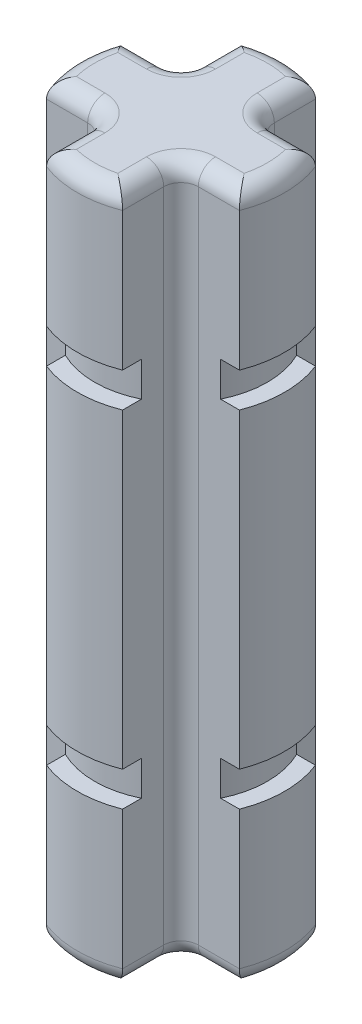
ISO-10303-21;
HEADER;
FILE_DESCRIPTION(('STEP AP214'),'2;1');
FILE_NAME('part.step','',(''),(''),'','','');
FILE_SCHEMA(('AUTOMOTIVE_DESIGN { 1 0 10303 214 1 1 1 1 }'));
ENDSEC;
DATA;
#1=APPLICATION_CONTEXT('core data for automotive mechanical design processes');
#2=APPLICATION_PROTOCOL_DEFINITION('international standard','automotive_design',2000,#1);
#3=PRODUCT_CONTEXT('',#1,'mechanical');
#4=PRODUCT('Part','Part','',(#3));
#5=PRODUCT_RELATED_PRODUCT_CATEGORY('part','',(#4));
#6=PRODUCT_DEFINITION_FORMATION('','',#4);
#7=PRODUCT_DEFINITION_CONTEXT('part definition',#1,'design');
#8=PRODUCT_DEFINITION('design','',#6,#7);
#9=PRODUCT_DEFINITION_SHAPE('','',#8);
#10=(LENGTH_UNIT() NAMED_UNIT(*) SI_UNIT(.MILLI.,.METRE.));
#11=(NAMED_UNIT(*) PLANE_ANGLE_UNIT() SI_UNIT($,.RADIAN.));
#12=(NAMED_UNIT(*) SI_UNIT($,.STERADIAN.) SOLID_ANGLE_UNIT());
#13=UNCERTAINTY_MEASURE_WITH_UNIT(LENGTH_MEASURE(1.E-05),#10,'distance_accuracy_value','');
#14=(GEOMETRIC_REPRESENTATION_CONTEXT(3) GLOBAL_UNCERTAINTY_ASSIGNED_CONTEXT((#13)) GLOBAL_UNIT_ASSIGNED_CONTEXT((#10,
#11,#12)) REPRESENTATION_CONTEXT('',''));
#15=CARTESIAN_POINT('',(0.,0.,0.));
#16=DIRECTION('',(0.,0.,1.));
#17=DIRECTION('',(1.,0.,0.));
#18=AXIS2_PLACEMENT_3D('',#15,#16,#17);
#19=CARTESIAN_POINT('',(0.,16.,0.));
#20=DIRECTION('',(0.,-1.,0.));
#21=DIRECTION('',(0.,0.,-1.));
#22=AXIS2_PLACEMENT_3D('',#19,#20,#21);
#23=CYLINDRICAL_SURFACE('',#22,2.4);
#24=CARTESIAN_POINT('',(0.,4.4,0.));
#25=DIRECTION('',(0.,-1.,0.));
#26=DIRECTION('',(0.,0.,-1.));
#27=AXIS2_PLACEMENT_3D('',#24,#25,#26);
#28=CIRCLE('',#27,2.4);
#29=CARTESIAN_POINT('',(-2.23284571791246,4.4,0.880000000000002));
#30=VERTEX_POINT('',#29);
#31=CARTESIAN_POINT('',(-2.23284571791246,4.4,-0.88));
#32=VERTEX_POINT('',#31);
#33=EDGE_CURVE('E1486',#30,#32,#28,.T.);
#34=ORIENTED_EDGE('',*,*,#33,.F.);
#35=DIRECTION('',(0.,-1.,0.));
#36=VECTOR('',#35,1.);
#37=CARTESIAN_POINT('',(-2.23284571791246,16.,0.880000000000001));
#38=LINE('',#37,#36);
#39=CARTESIAN_POINT('',(-2.23284571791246,11.6,0.880000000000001));
#40=VERTEX_POINT('',#39);
#41=EDGE_CURVE('E671',#40,#30,#38,.T.);
#42=ORIENTED_EDGE('',*,*,#41,.F.);
#43=CARTESIAN_POINT('',(0.,11.6,0.));
#44=DIRECTION('',(0.,1.,0.));
#45=DIRECTION('',(0.,0.,1.));
#46=AXIS2_PLACEMENT_3D('',#43,#44,#45);
#47=CIRCLE('',#46,2.4);
#48=CARTESIAN_POINT('',(-2.23284571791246,11.6,-0.88));
#49=VERTEX_POINT('',#48);
#50=EDGE_CURVE('E1379',#49,#40,#47,.T.);
#51=ORIENTED_EDGE('',*,*,#50,.F.);
#52=DIRECTION('',(0.,-1.,0.));
#53=VECTOR('',#52,1.);
#54=CARTESIAN_POINT('',(-2.23284571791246,16.,-0.88));
#55=LINE('',#54,#53);
#56=EDGE_CURVE('E655',#49,#32,#55,.T.);
#57=ORIENTED_EDGE('',*,*,#56,.T.);
#58=EDGE_LOOP('',(#34,#42,#51,#57));
#59=FACE_BOUND('',#58,.T.);
#60=ADVANCED_FACE('F39',(#59),#23,.T.);
#61=CARTESIAN_POINT('',(0.,16.,0.));
#62=DIRECTION('',(0.,-1.,0.));
#63=DIRECTION('',(0.,0.,-1.));
#64=AXIS2_PLACEMENT_3D('',#61,#62,#63);
#65=CYLINDRICAL_SURFACE('',#64,2.4);
#66=CARTESIAN_POINT('',(0.880000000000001,4.4,2.23284571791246));
#67=VERTEX_POINT('',#66);
#68=CARTESIAN_POINT('',(-0.88,4.4,2.23284571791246));
#69=VERTEX_POINT('',#68);
#70=EDGE_CURVE('E1479',#67,#69,#28,.T.);
#71=ORIENTED_EDGE('',*,*,#70,.F.);
#72=DIRECTION('',(0.,-1.,0.));
#73=VECTOR('',#72,1.);
#74=CARTESIAN_POINT('',(0.88,16.,2.23284571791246));
#75=LINE('',#74,#73);
#76=CARTESIAN_POINT('',(0.88,11.6,2.23284571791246));
#77=VERTEX_POINT('',#76);
#78=EDGE_CURVE('E700',#77,#67,#75,.T.);
#79=ORIENTED_EDGE('',*,*,#78,.F.);
#80=CARTESIAN_POINT('',(-0.88,11.6,2.23284571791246));
#81=VERTEX_POINT('',#80);
#82=EDGE_CURVE('E1351',#81,#77,#47,.T.);
#83=ORIENTED_EDGE('',*,*,#82,.F.);
#84=DIRECTION('',(0.,-1.,0.));
#85=VECTOR('',#84,1.);
#86=CARTESIAN_POINT('',(-0.88,16.,2.23284571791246));
#87=LINE('',#86,#85);
#88=EDGE_CURVE('E683',#81,#69,#87,.T.);
#89=ORIENTED_EDGE('',*,*,#88,.T.);
#90=EDGE_LOOP('',(#71,#79,#83,#89));
#91=FACE_BOUND('',#90,.T.);
#92=ADVANCED_FACE('F611',(#91),#65,.T.);
#93=CARTESIAN_POINT('',(0.,16.,0.));
#94=DIRECTION('',(0.,-1.,0.));
#95=DIRECTION('',(0.,0.,-1.));
#96=AXIS2_PLACEMENT_3D('',#93,#94,#95);
#97=CYLINDRICAL_SURFACE('',#96,2.4);
#98=CARTESIAN_POINT('',(2.23284571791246,4.4,-0.88));
#99=VERTEX_POINT('',#98);
#100=CARTESIAN_POINT('',(2.23284571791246,4.4,0.880000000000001));
#101=VERTEX_POINT('',#100);
#102=EDGE_CURVE('E1474',#99,#101,#28,.T.);
#103=ORIENTED_EDGE('',*,*,#102,.F.);
#104=DIRECTION('',(0.,-1.,0.));
#105=VECTOR('',#104,1.);
#106=CARTESIAN_POINT('',(2.23284571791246,16.,-0.88));
#107=LINE('',#106,#105);
#108=CARTESIAN_POINT('',(2.23284571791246,11.6,-0.88));
#109=VERTEX_POINT('',#108);
#110=EDGE_CURVE('E731',#109,#99,#107,.T.);
#111=ORIENTED_EDGE('',*,*,#110,.F.);
#112=CARTESIAN_POINT('',(2.23284571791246,11.6,0.880000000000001));
#113=VERTEX_POINT('',#112);
#114=EDGE_CURVE('E1350',#113,#109,#47,.T.);
#115=ORIENTED_EDGE('',*,*,#114,.F.);
#116=DIRECTION('',(0.,-1.,0.));
#117=VECTOR('',#116,1.);
#118=CARTESIAN_POINT('',(2.23284571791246,16.,0.880000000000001));
#119=LINE('',#118,#117);
#120=EDGE_CURVE('E714',#113,#101,#119,.T.);
#121=ORIENTED_EDGE('',*,*,#120,.T.);
#122=EDGE_LOOP('',(#103,#111,#115,#121));
#123=FACE_BOUND('',#122,.T.);
#124=ADVANCED_FACE('F619',(#123),#97,.T.);
#125=CARTESIAN_POINT('',(0.,16.,0.));
#126=DIRECTION('',(0.,-1.,0.));
#127=DIRECTION('',(0.,0.,-1.));
#128=AXIS2_PLACEMENT_3D('',#125,#126,#127);
#129=CYLINDRICAL_SURFACE('',#128,2.4);
#130=CARTESIAN_POINT('',(-0.88,4.4,-2.23284571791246));
#131=VERTEX_POINT('',#130);
#132=CARTESIAN_POINT('',(0.880000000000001,4.4,-2.23284571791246));
#133=VERTEX_POINT('',#132);
#134=EDGE_CURVE('E448',#131,#133,#28,.T.);
#135=ORIENTED_EDGE('',*,*,#134,.F.);
#136=DIRECTION('',(0.,-1.,0.));
#137=VECTOR('',#136,1.);
#138=CARTESIAN_POINT('',(-0.88,16.,-2.23284571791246));
#139=LINE('',#138,#137);
#140=CARTESIAN_POINT('',(-0.88,11.6,-2.23284571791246));
#141=VERTEX_POINT('',#140);
#142=EDGE_CURVE('E759',#141,#131,#139,.T.);
#143=ORIENTED_EDGE('',*,*,#142,.F.);
#144=CARTESIAN_POINT('',(0.,11.6,0.));
#145=DIRECTION('',(0.,1.,0.));
#146=DIRECTION('',(0.,0.,1.));
#147=AXIS2_PLACEMENT_3D('',#144,#145,#146);
#148=CIRCLE('',#147,2.4);
#149=CARTESIAN_POINT('',(0.880000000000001,11.6,-2.23284571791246));
#150=VERTEX_POINT('',#149);
#151=EDGE_CURVE('E476',#150,#141,#148,.T.);
#152=ORIENTED_EDGE('',*,*,#151,.F.);
#153=DIRECTION('',(0.,-1.,0.));
#154=VECTOR('',#153,1.);
#155=CARTESIAN_POINT('',(0.880000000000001,16.,-2.23284571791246));
#156=LINE('',#155,#154);
#157=EDGE_CURVE('E745',#150,#133,#156,.T.);
#158=ORIENTED_EDGE('',*,*,#157,.T.);
#159=EDGE_LOOP('',(#135,#143,#152,#158));
#160=FACE_BOUND('',#159,.T.);
#161=ADVANCED_FACE('F628',(#160),#129,.T.);
#162=CARTESIAN_POINT('',(-2.23284571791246,3.6,0.880000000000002));
#163=VERTEX_POINT('',#162);
#164=CARTESIAN_POINT('',(-2.23284571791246,0.399999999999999,0.880000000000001));
#165=VERTEX_POINT('',#164);
#166=EDGE_CURVE('E672',#163,#165,#38,.T.);
#167=ORIENTED_EDGE('',*,*,#166,.F.);
#168=CARTESIAN_POINT('',(0.,3.6,0.));
#169=DIRECTION('',(0.,-1.,0.));
#170=DIRECTION('',(0.,0.,-1.));
#171=AXIS2_PLACEMENT_3D('',#168,#169,#170);
#172=CIRCLE('',#171,2.4);
#173=CARTESIAN_POINT('',(-2.23284571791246,3.6,-0.88));
#174=VERTEX_POINT('',#173);
#175=EDGE_CURVE('E1597',#163,#174,#172,.T.);
#176=ORIENTED_EDGE('',*,*,#175,.T.);
#177=CARTESIAN_POINT('',(-2.23284571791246,0.399999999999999,-0.88));
#178=VERTEX_POINT('',#177);
#179=EDGE_CURVE('E657',#174,#178,#55,.T.);
#180=ORIENTED_EDGE('',*,*,#179,.T.);
#181=CARTESIAN_POINT('',(0.,0.399999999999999,0.));
#182=DIRECTION('',(0.,1.,0.));
#183=DIRECTION('',(0.,0.,1.));
#184=AXIS2_PLACEMENT_3D('',#181,#182,#183);
#185=CIRCLE('',#184,2.4);
#186=EDGE_CURVE('E1097',#178,#165,#185,.T.);
#187=ORIENTED_EDGE('',*,*,#186,.T.);
#188=EDGE_LOOP('',(#167,#176,#180,#187));
#189=FACE_BOUND('',#188,.T.);
#190=ADVANCED_FACE('F614',(#189),#23,.T.);
#191=CARTESIAN_POINT('',(0.880000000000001,3.6,2.23284571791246));
#192=VERTEX_POINT('',#191);
#193=CARTESIAN_POINT('',(0.88,0.399999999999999,2.23284571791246));
#194=VERTEX_POINT('',#193);
#195=EDGE_CURVE('E701',#192,#194,#75,.T.);
#196=ORIENTED_EDGE('',*,*,#195,.F.);
#197=CARTESIAN_POINT('',(-0.88,3.6,2.23284571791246));
#198=VERTEX_POINT('',#197);
#199=EDGE_CURVE('E1570',#192,#198,#172,.T.);
#200=ORIENTED_EDGE('',*,*,#199,.T.);
#201=CARTESIAN_POINT('',(-0.88,0.399999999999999,2.23284571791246));
#202=VERTEX_POINT('',#201);
#203=EDGE_CURVE('E684',#198,#202,#87,.T.);
#204=ORIENTED_EDGE('',*,*,#203,.T.);
#205=CARTESIAN_POINT('',(0.,0.399999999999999,0.));
#206=DIRECTION('',(0.,1.,0.));
#207=DIRECTION('',(0.,0.,1.));
#208=AXIS2_PLACEMENT_3D('',#205,#206,#207);
#209=CIRCLE('',#208,2.4);
#210=EDGE_CURVE('E1122',#202,#194,#209,.T.);
#211=ORIENTED_EDGE('',*,*,#210,.T.);
#212=EDGE_LOOP('',(#196,#200,#204,#211));
#213=FACE_BOUND('',#212,.T.);
#214=ADVANCED_FACE('F622',(#213),#65,.T.);
#215=CARTESIAN_POINT('',(2.23284571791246,3.6,-0.88));
#216=VERTEX_POINT('',#215);
#217=CARTESIAN_POINT('',(2.23284571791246,0.399999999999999,-0.88));
#218=VERTEX_POINT('',#217);
#219=EDGE_CURVE('E732',#216,#218,#107,.T.);
#220=ORIENTED_EDGE('',*,*,#219,.F.);
#221=CARTESIAN_POINT('',(2.23284571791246,3.6,0.880000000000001));
#222=VERTEX_POINT('',#221);
#223=EDGE_CURVE('E1540',#216,#222,#172,.T.);
#224=ORIENTED_EDGE('',*,*,#223,.T.);
#225=CARTESIAN_POINT('',(2.23284571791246,0.399999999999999,0.880000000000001));
#226=VERTEX_POINT('',#225);
#227=EDGE_CURVE('E715',#222,#226,#119,.T.);
#228=ORIENTED_EDGE('',*,*,#227,.T.);
#229=CARTESIAN_POINT('',(0.,0.399999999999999,0.));
#230=DIRECTION('',(0.,1.,0.));
#231=DIRECTION('',(0.,0.,1.));
#232=AXIS2_PLACEMENT_3D('',#229,#230,#231);
#233=CIRCLE('',#232,2.4);
#234=EDGE_CURVE('E1147',#226,#218,#233,.T.);
#235=ORIENTED_EDGE('',*,*,#234,.T.);
#236=EDGE_LOOP('',(#220,#224,#228,#235));
#237=FACE_BOUND('',#236,.T.);
#238=ADVANCED_FACE('F1564',(#237),#97,.T.);
#239=CARTESIAN_POINT('',(-0.88,3.6,-2.23284571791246));
#240=VERTEX_POINT('',#239);
#241=CARTESIAN_POINT('',(-0.88,0.399999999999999,-2.23284571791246));
#242=VERTEX_POINT('',#241);
#243=EDGE_CURVE('E489',#240,#242,#139,.T.);
#244=ORIENTED_EDGE('',*,*,#243,.F.);
#245=CARTESIAN_POINT('',(0.880000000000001,3.6,-2.23284571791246));
#246=VERTEX_POINT('',#245);
#247=EDGE_CURVE('E1590',#240,#246,#172,.T.);
#248=ORIENTED_EDGE('',*,*,#247,.T.);
#249=CARTESIAN_POINT('',(0.880000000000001,0.399999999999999,-2.23284571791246));
#250=VERTEX_POINT('',#249);
#251=EDGE_CURVE('E746',#246,#250,#156,.T.);
#252=ORIENTED_EDGE('',*,*,#251,.T.);
#253=CARTESIAN_POINT('',(0.,0.399999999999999,0.));
#254=DIRECTION('',(0.,1.,0.));
#255=DIRECTION('',(0.,0.,1.));
#256=AXIS2_PLACEMENT_3D('',#253,#254,#255);
#257=CIRCLE('',#256,2.4);
#258=EDGE_CURVE('E773',#250,#242,#257,.T.);
#259=ORIENTED_EDGE('',*,*,#258,.T.);
#260=EDGE_LOOP('',(#244,#248,#252,#259));
#261=FACE_BOUND('',#260,.T.);
#262=ADVANCED_FACE('F775',(#261),#129,.T.);
#263=CARTESIAN_POINT('',(0.,0.,0.));
#264=DIRECTION('',(0.,1.,0.));
#265=DIRECTION('',(0.,0.,1.));
#266=AXIS2_PLACEMENT_3D('',#263,#264,#265);
#267=PLANE('',#266);
#268=CARTESIAN_POINT('',(-1.28,0.,1.28));
#269=DIRECTION('',(0.,1.,0.));
#270=DIRECTION('',(0.,0.,1.));
#271=AXIS2_PLACEMENT_3D('',#268,#269,#270);
#272=CIRCLE('',#271,0.8);
#273=CARTESIAN_POINT('',(-1.28,0.,0.480000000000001));
#274=VERTEX_POINT('',#273);
#275=CARTESIAN_POINT('',(-0.48,0.,1.28));
#276=VERTEX_POINT('',#275);
#277=EDGE_CURVE('E1091',#274,#276,#272,.F.);
#278=ORIENTED_EDGE('',*,*,#277,.F.);
#279=DIRECTION('',(1.,0.,0.));
#280=VECTOR('',#279,1.);
#281=CARTESIAN_POINT('',(0.,0.,0.480000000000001));
#282=LINE('',#281,#280);
#283=CARTESIAN_POINT('',(-1.94154577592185,0.,0.480000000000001));
#284=VERTEX_POINT('',#283);
#285=EDGE_CURVE('E1088',#274,#284,#282,.F.);
#286=ORIENTED_EDGE('',*,*,#285,.T.);
#287=CARTESIAN_POINT('',(0.,0.,0.));
#288=DIRECTION('',(0.,1.,0.));
#289=DIRECTION('',(0.,0.,1.));
#290=AXIS2_PLACEMENT_3D('',#287,#288,#289);
#291=CIRCLE('',#290,2.);
#292=CARTESIAN_POINT('',(-1.94154577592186,0.,-0.48));
#293=VERTEX_POINT('',#292);
#294=EDGE_CURVE('E1072',#284,#293,#291,.F.);
#295=ORIENTED_EDGE('',*,*,#294,.T.);
#296=DIRECTION('',(-1.,0.,0.));
#297=VECTOR('',#296,1.);
#298=CARTESIAN_POINT('',(0.,0.,-0.48));
#299=LINE('',#298,#297);
#300=CARTESIAN_POINT('',(-1.28,0.,-0.48));
#301=VERTEX_POINT('',#300);
#302=EDGE_CURVE('E1056',#293,#301,#299,.F.);
#303=ORIENTED_EDGE('',*,*,#302,.T.);
#304=CARTESIAN_POINT('',(-1.28,0.,-1.28));
#305=DIRECTION('',(0.,1.,0.));
#306=DIRECTION('',(0.,0.,1.));
#307=AXIS2_PLACEMENT_3D('',#304,#305,#306);
#308=CIRCLE('',#307,0.8);
#309=CARTESIAN_POINT('',(-0.48,0.,-1.28));
#310=VERTEX_POINT('',#309);
#311=EDGE_CURVE('E1063',#310,#301,#308,.F.);
#312=ORIENTED_EDGE('',*,*,#311,.F.);
#313=DIRECTION('',(0.,0.,1.));
#314=VECTOR('',#313,1.);
#315=CARTESIAN_POINT('',(-0.48,0.,0.));
#316=LINE('',#315,#314);
#317=CARTESIAN_POINT('',(-0.48,0.,-1.94154577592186));
#318=VERTEX_POINT('',#317);
#319=EDGE_CURVE('E1619',#310,#318,#316,.F.);
#320=ORIENTED_EDGE('',*,*,#319,.T.);
#321=CARTESIAN_POINT('',(0.,0.,0.));
#322=DIRECTION('',(0.,1.,0.));
#323=DIRECTION('',(0.,0.,1.));
#324=AXIS2_PLACEMENT_3D('',#321,#322,#323);
#325=CIRCLE('',#324,2.);
#326=CARTESIAN_POINT('',(0.480000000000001,0.,-1.94154577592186));
#327=VERTEX_POINT('',#326);
#328=EDGE_CURVE('E787',#318,#327,#325,.F.);
#329=ORIENTED_EDGE('',*,*,#328,.T.);
#330=DIRECTION('',(0.,0.,-1.));
#331=VECTOR('',#330,1.);
#332=CARTESIAN_POINT('',(0.480000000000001,0.,0.));
#333=LINE('',#332,#331);
#334=CARTESIAN_POINT('',(0.480000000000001,0.,-1.28));
#335=VERTEX_POINT('',#334);
#336=EDGE_CURVE('E1040',#327,#335,#333,.F.);
#337=ORIENTED_EDGE('',*,*,#336,.T.);
#338=CARTESIAN_POINT('',(1.28,0.,-1.28));
#339=DIRECTION('',(0.,1.,0.));
#340=DIRECTION('',(0.,0.,1.));
#341=AXIS2_PLACEMENT_3D('',#338,#339,#340);
#342=CIRCLE('',#341,0.8);
#343=CARTESIAN_POINT('',(1.28,0.,-0.48));
#344=VERTEX_POINT('',#343);
#345=EDGE_CURVE('E1049',#344,#335,#342,.F.);
#346=ORIENTED_EDGE('',*,*,#345,.F.);
#347=DIRECTION('',(-1.,0.,0.));
#348=VECTOR('',#347,1.);
#349=CARTESIAN_POINT('',(0.,0.,-0.48));
#350=LINE('',#349,#348);
#351=CARTESIAN_POINT('',(1.94154577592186,0.,-0.48));
#352=VERTEX_POINT('',#351);
#353=EDGE_CURVE('E1055',#344,#352,#350,.F.);
#354=ORIENTED_EDGE('',*,*,#353,.T.);
#355=CARTESIAN_POINT('',(0.,0.,0.));
#356=DIRECTION('',(0.,1.,0.));
#357=DIRECTION('',(0.,0.,1.));
#358=AXIS2_PLACEMENT_3D('',#355,#356,#357);
#359=CIRCLE('',#358,2.);
#360=CARTESIAN_POINT('',(1.94154577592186,0.,0.480000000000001));
#361=VERTEX_POINT('',#360);
#362=EDGE_CURVE('E1060',#352,#361,#359,.F.);
#363=ORIENTED_EDGE('',*,*,#362,.T.);
#364=DIRECTION('',(1.,0.,0.));
#365=VECTOR('',#364,1.);
#366=CARTESIAN_POINT('',(0.,0.,0.480000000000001));
#367=LINE('',#366,#365);
#368=CARTESIAN_POINT('',(1.28,0.,0.480000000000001));
#369=VERTEX_POINT('',#368);
#370=EDGE_CURVE('E1069',#361,#369,#367,.F.);
#371=ORIENTED_EDGE('',*,*,#370,.T.);
#372=CARTESIAN_POINT('',(1.28,0.,1.28));
#373=DIRECTION('',(0.,1.,0.));
#374=DIRECTION('',(0.,0.,1.));
#375=AXIS2_PLACEMENT_3D('',#372,#373,#374);
#376=CIRCLE('',#375,0.8);
#377=CARTESIAN_POINT('',(0.480000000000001,0.,1.28));
#378=VERTEX_POINT('',#377);
#379=EDGE_CURVE('E1075',#378,#369,#376,.F.);
#380=ORIENTED_EDGE('',*,*,#379,.F.);
#381=DIRECTION('',(0.,0.,-1.));
#382=VECTOR('',#381,1.);
#383=CARTESIAN_POINT('',(0.480000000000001,0.,0.));
#384=LINE('',#383,#382);
#385=CARTESIAN_POINT('',(0.480000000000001,0.,1.94154577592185));
#386=VERTEX_POINT('',#385);
#387=EDGE_CURVE('E1079',#378,#386,#384,.F.);
#388=ORIENTED_EDGE('',*,*,#387,.T.);
#389=CARTESIAN_POINT('',(0.,0.,0.));
#390=DIRECTION('',(0.,1.,0.));
#391=DIRECTION('',(0.,0.,1.));
#392=AXIS2_PLACEMENT_3D('',#389,#390,#391);
#393=CIRCLE('',#392,2.);
#394=CARTESIAN_POINT('',(-0.48,0.,1.94154577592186));
#395=VERTEX_POINT('',#394);
#396=EDGE_CURVE('E1082',#386,#395,#393,.F.);
#397=ORIENTED_EDGE('',*,*,#396,.T.);
#398=DIRECTION('',(0.,0.,1.));
#399=VECTOR('',#398,1.);
#400=CARTESIAN_POINT('',(-0.48,0.,0.));
#401=LINE('',#400,#399);
#402=EDGE_CURVE('E1085',#395,#276,#401,.F.);
#403=ORIENTED_EDGE('',*,*,#402,.T.);
#404=EDGE_LOOP('',(#278,#286,#295,#303,#312,#320,#329,#337,#346,#354,#363,#371,#380,#388,#397,#403));
#405=FACE_BOUND('',#404,.T.);
#406=ADVANCED_FACE('F1577',(#405),#267,.F.);
#407=CARTESIAN_POINT('',(-0.88,16.,-2.23284571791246));
#408=DIRECTION('',(1.,0.,0.));
#409=DIRECTION('',(0.,0.,-1.));
#410=AXIS2_PLACEMENT_3D('',#407,#408,#409);
#411=PLANE('',#410);
#412=DIRECTION('',(0.,1.,0.));
#413=VECTOR('',#412,1.);
#414=CARTESIAN_POINT('',(-0.88,3.6,-1.79599554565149));
#415=LINE('',#414,#413);
#416=CARTESIAN_POINT('',(-0.88,4.4,-1.79599554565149));
#417=VERTEX_POINT('',#416);
#418=CARTESIAN_POINT('',(-0.88,3.6,-1.79599554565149));
#419=VERTEX_POINT('',#418);
#420=EDGE_CURVE('E461',#417,#419,#415,.F.);
#421=ORIENTED_EDGE('',*,*,#420,.T.);
#422=DIRECTION('',(0.,0.,-1.));
#423=VECTOR('',#422,1.);
#424=CARTESIAN_POINT('',(-0.88,3.6,-2.23284571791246));
#425=LINE('',#424,#423);
#426=EDGE_CURVE('E772',#419,#240,#425,.T.);
#427=ORIENTED_EDGE('',*,*,#426,.T.);
#428=ORIENTED_EDGE('',*,*,#243,.T.);
#429=DIRECTION('',(0.,0.,1.));
#430=VECTOR('',#429,1.);
#431=CARTESIAN_POINT('',(-0.88,0.399999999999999,-2.23284571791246));
#432=LINE('',#431,#430);
#433=CARTESIAN_POINT('',(-0.88,0.399999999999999,-1.28));
#434=VERTEX_POINT('',#433);
#435=EDGE_CURVE('E770',#242,#434,#432,.T.);
#436=ORIENTED_EDGE('',*,*,#435,.T.);
#437=DIRECTION('',(0.,-1.,0.));
#438=VECTOR('',#437,1.);
#439=CARTESIAN_POINT('',(-0.88,16.,-1.28));
#440=LINE('',#439,#438);
#441=CARTESIAN_POINT('',(-0.88,15.6,-1.28));
#442=VERTEX_POINT('',#441);
#443=EDGE_CURVE('E780',#434,#442,#440,.F.);
#444=ORIENTED_EDGE('',*,*,#443,.T.);
#445=DIRECTION('',(0.,0.,1.));
#446=VECTOR('',#445,1.);
#447=CARTESIAN_POINT('',(-0.88,15.6,-2.23284571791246));
#448=LINE('',#447,#446);
#449=CARTESIAN_POINT('',(-0.88,15.6,-2.23284571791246));
#450=VERTEX_POINT('',#449);
#451=EDGE_CURVE('E801',#442,#450,#448,.F.);
#452=ORIENTED_EDGE('',*,*,#451,.T.);
#453=CARTESIAN_POINT('',(-0.88,12.4,-2.23284571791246));
#454=VERTEX_POINT('',#453);
#455=EDGE_CURVE('E752',#450,#454,#139,.T.);
#456=ORIENTED_EDGE('',*,*,#455,.T.);
#457=DIRECTION('',(0.,0.,1.));
#458=VECTOR('',#457,1.);
#459=CARTESIAN_POINT('',(-0.88,12.4,-2.23284571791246));
#460=LINE('',#459,#458);
#461=CARTESIAN_POINT('',(-0.88,12.4,-1.79599554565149));
#462=VERTEX_POINT('',#461);
#463=EDGE_CURVE('E1299',#454,#462,#460,.T.);
#464=ORIENTED_EDGE('',*,*,#463,.T.);
#465=DIRECTION('',(0.,-1.,0.));
#466=VECTOR('',#465,1.);
#467=CARTESIAN_POINT('',(-0.88,12.4,-1.79599554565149));
#468=LINE('',#467,#466);
#469=CARTESIAN_POINT('',(-0.88,11.6,-1.79599554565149));
#470=VERTEX_POINT('',#469);
#471=EDGE_CURVE('E868',#462,#470,#468,.T.);
#472=ORIENTED_EDGE('',*,*,#471,.T.);
#473=DIRECTION('',(0.,0.,1.));
#474=VECTOR('',#473,1.);
#475=CARTESIAN_POINT('',(-0.88,11.6,-2.23284571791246));
#476=LINE('',#475,#474);
#477=EDGE_CURVE('E1273',#141,#470,#476,.T.);
#478=ORIENTED_EDGE('',*,*,#477,.F.);
#479=ORIENTED_EDGE('',*,*,#142,.T.);
#480=DIRECTION('',(0.,0.,-1.));
#481=VECTOR('',#480,1.);
#482=CARTESIAN_POINT('',(-0.88,4.4,-2.23284571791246));
#483=LINE('',#482,#481);
#484=EDGE_CURVE('E1392',#417,#131,#483,.T.);
#485=ORIENTED_EDGE('',*,*,#484,.F.);
#486=EDGE_LOOP('',(#421,#427,#428,#436,#444,#452,#456,#464,#472,#478,#479,#485));
#487=FACE_BOUND('',#486,.T.);
#488=ADVANCED_FACE('F640',(#487),#411,.F.);
#489=CARTESIAN_POINT('',(-2.23284571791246,16.,-0.88));
#490=DIRECTION('',(0.,0.,1.));
#491=DIRECTION('',(1.,0.,0.));
#492=AXIS2_PLACEMENT_3D('',#489,#490,#491);
#493=PLANE('',#492);
#494=ORIENTED_EDGE('',*,*,#179,.F.);
#495=DIRECTION('',(1.,0.,0.));
#496=VECTOR('',#495,1.);
#497=CARTESIAN_POINT('',(-2.23284571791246,3.6,-0.88));
#498=LINE('',#497,#496);
#499=CARTESIAN_POINT('',(-1.79599554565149,3.6,-0.88));
#500=VERTEX_POINT('',#499);
#501=EDGE_CURVE('E1442',#174,#500,#498,.T.);
#502=ORIENTED_EDGE('',*,*,#501,.T.);
#503=DIRECTION('',(0.,1.,0.));
#504=VECTOR('',#503,1.);
#505=CARTESIAN_POINT('',(-1.79599554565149,3.6,-0.88));
#506=LINE('',#505,#504);
#507=CARTESIAN_POINT('',(-1.79599554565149,4.4,-0.88));
#508=VERTEX_POINT('',#507);
#509=EDGE_CURVE('E1390',#500,#508,#506,.T.);
#510=ORIENTED_EDGE('',*,*,#509,.T.);
#511=DIRECTION('',(1.,0.,0.));
#512=VECTOR('',#511,1.);
#513=CARTESIAN_POINT('',(-2.23284571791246,4.4,-0.88));
#514=LINE('',#513,#512);
#515=EDGE_CURVE('E1388',#32,#508,#514,.T.);
#516=ORIENTED_EDGE('',*,*,#515,.F.);
#517=ORIENTED_EDGE('',*,*,#56,.F.);
#518=DIRECTION('',(-1.,0.,0.));
#519=VECTOR('',#518,1.);
#520=CARTESIAN_POINT('',(-2.23284571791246,11.6,-0.88));
#521=LINE('',#520,#519);
#522=CARTESIAN_POINT('',(-1.79599554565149,11.6,-0.88));
#523=VERTEX_POINT('',#522);
#524=EDGE_CURVE('E1279',#523,#49,#521,.T.);
#525=ORIENTED_EDGE('',*,*,#524,.F.);
#526=DIRECTION('',(0.,-1.,0.));
#527=VECTOR('',#526,1.);
#528=CARTESIAN_POINT('',(-1.79599554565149,12.4,-0.88));
#529=LINE('',#528,#527);
#530=CARTESIAN_POINT('',(-1.79599554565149,12.4,-0.88));
#531=VERTEX_POINT('',#530);
#532=EDGE_CURVE('E1322',#523,#531,#529,.F.);
#533=ORIENTED_EDGE('',*,*,#532,.T.);
#534=DIRECTION('',(-1.,0.,0.));
#535=VECTOR('',#534,1.);
#536=CARTESIAN_POINT('',(-2.23284571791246,12.4,-0.88));
#537=LINE('',#536,#535);
#538=CARTESIAN_POINT('',(-2.23284571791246,12.4,-0.88));
#539=VERTEX_POINT('',#538);
#540=EDGE_CURVE('E1296',#531,#539,#537,.T.);
#541=ORIENTED_EDGE('',*,*,#540,.T.);
#542=CARTESIAN_POINT('',(-2.23284571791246,15.6,-0.88));
#543=VERTEX_POINT('',#542);
#544=EDGE_CURVE('E645',#543,#539,#55,.T.);
#545=ORIENTED_EDGE('',*,*,#544,.F.);
#546=DIRECTION('',(-1.,0.,0.));
#547=VECTOR('',#546,1.);
#548=CARTESIAN_POINT('',(-0.88,15.6,-0.88));
#549=LINE('',#548,#547);
#550=CARTESIAN_POINT('',(-1.28,15.6,-0.88));
#551=VERTEX_POINT('',#550);
#552=EDGE_CURVE('E660',#543,#551,#549,.F.);
#553=ORIENTED_EDGE('',*,*,#552,.T.);
#554=DIRECTION('',(0.,-1.,0.));
#555=VECTOR('',#554,1.);
#556=CARTESIAN_POINT('',(-1.28,0.,-0.88));
#557=LINE('',#556,#555);
#558=CARTESIAN_POINT('',(-1.28,0.399999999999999,-0.88));
#559=VERTEX_POINT('',#558);
#560=EDGE_CURVE('E654',#551,#559,#557,.T.);
#561=ORIENTED_EDGE('',*,*,#560,.T.);
#562=DIRECTION('',(-1.,0.,0.));
#563=VECTOR('',#562,1.);
#564=CARTESIAN_POINT('',(-2.23284571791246,0.399999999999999,-0.88));
#565=LINE('',#564,#563);
#566=EDGE_CURVE('E1182',#559,#178,#565,.T.);
#567=ORIENTED_EDGE('',*,*,#566,.T.);
#568=EDGE_LOOP('',(#494,#502,#510,#516,#517,#525,#533,#541,#545,#553,#561,#567));
#569=FACE_BOUND('',#568,.T.);
#570=ADVANCED_FACE('F632',(#569),#493,.F.);
#571=ORIENTED_EDGE('',*,*,#544,.T.);
#572=CARTESIAN_POINT('',(0.,12.4,0.));
#573=DIRECTION('',(0.,1.,0.));
#574=DIRECTION('',(0.,0.,1.));
#575=AXIS2_PLACEMENT_3D('',#572,#573,#574);
#576=CIRCLE('',#575,2.4);
#577=CARTESIAN_POINT('',(-2.23284571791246,12.4,0.880000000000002));
#578=VERTEX_POINT('',#577);
#579=EDGE_CURVE('E647',#539,#578,#576,.T.);
#580=ORIENTED_EDGE('',*,*,#579,.T.);
#581=CARTESIAN_POINT('',(-2.23284571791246,15.6,0.880000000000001));
#582=VERTEX_POINT('',#581);
#583=EDGE_CURVE('E665',#582,#578,#38,.T.);
#584=ORIENTED_EDGE('',*,*,#583,.F.);
#585=CARTESIAN_POINT('',(0.,15.6,0.));
#586=DIRECTION('',(0.,1.,0.));
#587=DIRECTION('',(0.,0.,1.));
#588=AXIS2_PLACEMENT_3D('',#585,#586,#587);
#589=CIRCLE('',#588,2.4);
#590=EDGE_CURVE('E650',#582,#543,#589,.F.);
#591=ORIENTED_EDGE('',*,*,#590,.T.);
#592=EDGE_LOOP('',(#571,#580,#584,#591));
#593=FACE_BOUND('',#592,.T.);
#594=ADVANCED_FACE('F615',(#593),#23,.T.);
#595=CARTESIAN_POINT('',(-0.88,16.,0.880000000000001));
#596=DIRECTION('',(0.,0.,-1.));
#597=DIRECTION('',(-1.,0.,0.));
#598=AXIS2_PLACEMENT_3D('',#595,#596,#597);
#599=PLANE('',#598);
#600=DIRECTION('',(0.,1.,0.));
#601=VECTOR('',#600,1.);
#602=CARTESIAN_POINT('',(-1.79599554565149,3.6,0.880000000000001));
#603=LINE('',#602,#601);
#604=CARTESIAN_POINT('',(-1.79599554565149,4.4,0.880000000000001));
#605=VERTEX_POINT('',#604);
#606=CARTESIAN_POINT('',(-1.79599554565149,3.6,0.880000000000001));
#607=VERTEX_POINT('',#606);
#608=EDGE_CURVE('E1418',#605,#607,#603,.F.);
#609=ORIENTED_EDGE('',*,*,#608,.T.);
#610=DIRECTION('',(-1.,0.,0.));
#611=VECTOR('',#610,1.);
#612=CARTESIAN_POINT('',(-0.88,3.6,0.880000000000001));
#613=LINE('',#612,#611);
#614=EDGE_CURVE('E1439',#607,#163,#613,.T.);
#615=ORIENTED_EDGE('',*,*,#614,.T.);
#616=ORIENTED_EDGE('',*,*,#166,.T.);
#617=DIRECTION('',(1.,0.,0.));
#618=VECTOR('',#617,1.);
#619=CARTESIAN_POINT('',(-0.88,0.399999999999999,0.880000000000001));
#620=LINE('',#619,#618);
#621=CARTESIAN_POINT('',(-1.28,0.399999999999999,0.880000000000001));
#622=VERTEX_POINT('',#621);
#623=EDGE_CURVE('E1106',#165,#622,#620,.T.);
#624=ORIENTED_EDGE('',*,*,#623,.T.);
#625=DIRECTION('',(0.,-1.,0.));
#626=VECTOR('',#625,1.);
#627=CARTESIAN_POINT('',(-1.28,16.,0.880000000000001));
#628=LINE('',#627,#626);
#629=CARTESIAN_POINT('',(-1.28,15.6,0.880000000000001));
#630=VERTEX_POINT('',#629);
#631=EDGE_CURVE('E1100',#622,#630,#628,.F.);
#632=ORIENTED_EDGE('',*,*,#631,.T.);
#633=DIRECTION('',(1.,0.,0.));
#634=VECTOR('',#633,1.);
#635=CARTESIAN_POINT('',(-2.23284571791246,15.6,0.880000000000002));
#636=LINE('',#635,#634);
#637=EDGE_CURVE('E1103',#630,#582,#636,.F.);
#638=ORIENTED_EDGE('',*,*,#637,.T.);
#639=ORIENTED_EDGE('',*,*,#583,.T.);
#640=DIRECTION('',(1.,0.,0.));
#641=VECTOR('',#640,1.);
#642=CARTESIAN_POINT('',(-0.88,12.4,0.880000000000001));
#643=LINE('',#642,#641);
#644=CARTESIAN_POINT('',(-1.79599554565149,12.4,0.880000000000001));
#645=VERTEX_POINT('',#644);
#646=EDGE_CURVE('E1293',#578,#645,#643,.T.);
#647=ORIENTED_EDGE('',*,*,#646,.T.);
#648=DIRECTION('',(0.,-1.,0.));
#649=VECTOR('',#648,1.);
#650=CARTESIAN_POINT('',(-1.79599554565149,12.4,0.880000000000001));
#651=LINE('',#650,#649);
#652=CARTESIAN_POINT('',(-1.79599554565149,11.6,0.880000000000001));
#653=VERTEX_POINT('',#652);
#654=EDGE_CURVE('E1318',#645,#653,#651,.T.);
#655=ORIENTED_EDGE('',*,*,#654,.T.);
#656=DIRECTION('',(1.,0.,0.));
#657=VECTOR('',#656,1.);
#658=CARTESIAN_POINT('',(-0.88,11.6,0.880000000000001));
#659=LINE('',#658,#657);
#660=EDGE_CURVE('E1371',#40,#653,#659,.T.);
#661=ORIENTED_EDGE('',*,*,#660,.F.);
#662=ORIENTED_EDGE('',*,*,#41,.T.);
#663=DIRECTION('',(-1.,0.,0.));
#664=VECTOR('',#663,1.);
#665=CARTESIAN_POINT('',(-0.88,4.4,0.880000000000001));
#666=LINE('',#665,#664);
#667=EDGE_CURVE('E1393',#605,#30,#666,.T.);
#668=ORIENTED_EDGE('',*,*,#667,.F.);
#669=EDGE_LOOP('',(#609,#615,#616,#624,#632,#638,#639,#647,#655,#661,#662,#668));
#670=FACE_BOUND('',#669,.T.);
#671=ADVANCED_FACE('F631',(#670),#599,.F.);
#672=CARTESIAN_POINT('',(-0.88,16.,0.880000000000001));
#673=DIRECTION('',(1.,0.,0.));
#674=DIRECTION('',(0.,0.,-1.));
#675=AXIS2_PLACEMENT_3D('',#672,#673,#674);
#676=PLANE('',#675);
#677=ORIENTED_EDGE('',*,*,#203,.F.);
#678=DIRECTION('',(0.,0.,-1.));
#679=VECTOR('',#678,1.);
#680=CARTESIAN_POINT('',(-0.88,3.6,0.880000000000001));
#681=LINE('',#680,#679);
#682=CARTESIAN_POINT('',(-0.88,3.6,1.79599554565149));
#683=VERTEX_POINT('',#682);
#684=EDGE_CURVE('E1435',#198,#683,#681,.T.);
#685=ORIENTED_EDGE('',*,*,#684,.T.);
#686=DIRECTION('',(0.,1.,0.));
#687=VECTOR('',#686,1.);
#688=CARTESIAN_POINT('',(-0.88,3.6,1.79599554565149));
#689=LINE('',#688,#687);
#690=CARTESIAN_POINT('',(-0.88,4.4,1.79599554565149));
#691=VERTEX_POINT('',#690);
#692=EDGE_CURVE('E1414',#683,#691,#689,.T.);
#693=ORIENTED_EDGE('',*,*,#692,.T.);
#694=DIRECTION('',(0.,0.,-1.));
#695=VECTOR('',#694,1.);
#696=CARTESIAN_POINT('',(-0.88,4.4,0.880000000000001));
#697=LINE('',#696,#695);
#698=EDGE_CURVE('E1399',#69,#691,#697,.T.);
#699=ORIENTED_EDGE('',*,*,#698,.F.);
#700=ORIENTED_EDGE('',*,*,#88,.F.);
#701=DIRECTION('',(0.,0.,1.));
#702=VECTOR('',#701,1.);
#703=CARTESIAN_POINT('',(-0.88,11.6,0.880000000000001));
#704=LINE('',#703,#702);
#705=CARTESIAN_POINT('',(-0.88,11.6,1.79599554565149));
#706=VERTEX_POINT('',#705);
#707=EDGE_CURVE('E1368',#706,#81,#704,.T.);
#708=ORIENTED_EDGE('',*,*,#707,.F.);
#709=DIRECTION('',(0.,-1.,0.));
#710=VECTOR('',#709,1.);
#711=CARTESIAN_POINT('',(-0.88,12.4,1.79599554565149));
#712=LINE('',#711,#710);
#713=CARTESIAN_POINT('',(-0.88,12.4,1.79599554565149));
#714=VERTEX_POINT('',#713);
#715=EDGE_CURVE('E1314',#706,#714,#712,.F.);
#716=ORIENTED_EDGE('',*,*,#715,.T.);
#717=DIRECTION('',(0.,0.,1.));
#718=VECTOR('',#717,1.);
#719=CARTESIAN_POINT('',(-0.88,12.4,0.880000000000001));
#720=LINE('',#719,#718);
#721=CARTESIAN_POINT('',(-0.88,12.4,2.23284571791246));
#722=VERTEX_POINT('',#721);
#723=EDGE_CURVE('E1289',#714,#722,#720,.T.);
#724=ORIENTED_EDGE('',*,*,#723,.T.);
#725=CARTESIAN_POINT('',(-0.88,15.6,2.23284571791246));
#726=VERTEX_POINT('',#725);
#727=EDGE_CURVE('E678',#726,#722,#87,.T.);
#728=ORIENTED_EDGE('',*,*,#727,.F.);
#729=DIRECTION('',(0.,0.,1.));
#730=VECTOR('',#729,1.);
#731=CARTESIAN_POINT('',(-0.88,15.6,0.880000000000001));
#732=LINE('',#731,#730);
#733=CARTESIAN_POINT('',(-0.88,15.6,1.28));
#734=VERTEX_POINT('',#733);
#735=EDGE_CURVE('E1112',#726,#734,#732,.F.);
#736=ORIENTED_EDGE('',*,*,#735,.T.);
#737=DIRECTION('',(0.,-1.,0.));
#738=VECTOR('',#737,1.);
#739=CARTESIAN_POINT('',(-0.88,0.,1.28));
#740=LINE('',#739,#738);
#741=CARTESIAN_POINT('',(-0.88,0.399999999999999,1.28));
#742=VERTEX_POINT('',#741);
#743=EDGE_CURVE('E1109',#734,#742,#740,.T.);
#744=ORIENTED_EDGE('',*,*,#743,.T.);
#745=DIRECTION('',(0.,0.,1.));
#746=VECTOR('',#745,1.);
#747=CARTESIAN_POINT('',(-0.88,0.399999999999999,0.880000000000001));
#748=LINE('',#747,#746);
#749=EDGE_CURVE('E1115',#742,#202,#748,.T.);
#750=ORIENTED_EDGE('',*,*,#749,.T.);
#751=EDGE_LOOP('',(#677,#685,#693,#699,#700,#708,#716,#724,#728,#736,#744,#750));
#752=FACE_BOUND('',#751,.T.);
#753=ADVANCED_FACE('F638',(#752),#676,.F.);
#754=ORIENTED_EDGE('',*,*,#727,.T.);
#755=CARTESIAN_POINT('',(0.880000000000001,12.4,2.23284571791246));
#756=VERTEX_POINT('',#755);
#757=EDGE_CURVE('E1343',#722,#756,#576,.T.);
#758=ORIENTED_EDGE('',*,*,#757,.T.);
#759=CARTESIAN_POINT('',(0.88,15.6,2.23284571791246));
#760=VERTEX_POINT('',#759);
#761=EDGE_CURVE('E692',#760,#756,#75,.T.);
#762=ORIENTED_EDGE('',*,*,#761,.F.);
#763=CARTESIAN_POINT('',(0.,15.6,0.));
#764=DIRECTION('',(0.,1.,0.));
#765=DIRECTION('',(0.,0.,1.));
#766=AXIS2_PLACEMENT_3D('',#763,#764,#765);
#767=CIRCLE('',#766,2.4);
#768=EDGE_CURVE('E1119',#760,#726,#767,.F.);
#769=ORIENTED_EDGE('',*,*,#768,.T.);
#770=EDGE_LOOP('',(#754,#758,#762,#769));
#771=FACE_BOUND('',#770,.T.);
#772=ADVANCED_FACE('F623',(#771),#65,.T.);
#773=CARTESIAN_POINT('',(0.880000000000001,16.,2.23284571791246));
#774=DIRECTION('',(-1.,0.,0.));
#775=DIRECTION('',(0.,0.,1.));
#776=AXIS2_PLACEMENT_3D('',#773,#774,#775);
#777=PLANE('',#776);
#778=DIRECTION('',(0.,1.,0.));
#779=VECTOR('',#778,1.);
#780=CARTESIAN_POINT('',(0.880000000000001,3.6,1.79599554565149));
#781=LINE('',#780,#779);
#782=CARTESIAN_POINT('',(0.880000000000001,4.4,1.79599554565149));
#783=VERTEX_POINT('',#782);
#784=CARTESIAN_POINT('',(0.880000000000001,3.6,1.79599554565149));
#785=VERTEX_POINT('',#784);
#786=EDGE_CURVE('E1410',#783,#785,#781,.F.);
#787=ORIENTED_EDGE('',*,*,#786,.T.);
#788=DIRECTION('',(0.,0.,1.));
#789=VECTOR('',#788,1.);
#790=CARTESIAN_POINT('',(0.880000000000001,3.6,2.23284571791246));
#791=LINE('',#790,#789);
#792=EDGE_CURVE('E1432',#785,#192,#791,.T.);
#793=ORIENTED_EDGE('',*,*,#792,.T.);
#794=ORIENTED_EDGE('',*,*,#195,.T.);
#795=DIRECTION('',(0.,0.,-1.));
#796=VECTOR('',#795,1.);
#797=CARTESIAN_POINT('',(0.880000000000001,0.399999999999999,2.23284571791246));
#798=LINE('',#797,#796);
#799=CARTESIAN_POINT('',(0.880000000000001,0.399999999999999,1.28));
#800=VERTEX_POINT('',#799);
#801=EDGE_CURVE('E1131',#194,#800,#798,.T.);
#802=ORIENTED_EDGE('',*,*,#801,.T.);
#803=DIRECTION('',(0.,-1.,0.));
#804=VECTOR('',#803,1.);
#805=CARTESIAN_POINT('',(0.880000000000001,16.,1.28));
#806=LINE('',#805,#804);
#807=CARTESIAN_POINT('',(0.880000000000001,15.6,1.28));
#808=VERTEX_POINT('',#807);
#809=EDGE_CURVE('E1125',#800,#808,#806,.F.);
#810=ORIENTED_EDGE('',*,*,#809,.T.);
#811=DIRECTION('',(0.,0.,-1.));
#812=VECTOR('',#811,1.);
#813=CARTESIAN_POINT('',(0.880000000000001,15.6,2.23284571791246));
#814=LINE('',#813,#812);
#815=EDGE_CURVE('E1128',#808,#760,#814,.F.);
#816=ORIENTED_EDGE('',*,*,#815,.T.);
#817=ORIENTED_EDGE('',*,*,#761,.T.);
#818=DIRECTION('',(0.,0.,-1.));
#819=VECTOR('',#818,1.);
#820=CARTESIAN_POINT('',(0.880000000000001,12.4,2.23284571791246));
#821=LINE('',#820,#819);
#822=CARTESIAN_POINT('',(0.880000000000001,12.4,1.79599554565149));
#823=VERTEX_POINT('',#822);
#824=EDGE_CURVE('E1286',#756,#823,#821,.T.);
#825=ORIENTED_EDGE('',*,*,#824,.T.);
#826=DIRECTION('',(0.,-1.,0.));
#827=VECTOR('',#826,1.);
#828=CARTESIAN_POINT('',(0.880000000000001,12.4,1.79599554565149));
#829=LINE('',#828,#827);
#830=CARTESIAN_POINT('',(0.880000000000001,11.6,1.79599554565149));
#831=VERTEX_POINT('',#830);
#832=EDGE_CURVE('E1310',#823,#831,#829,.T.);
#833=ORIENTED_EDGE('',*,*,#832,.T.);
#834=DIRECTION('',(0.,0.,-1.));
#835=VECTOR('',#834,1.);
#836=CARTESIAN_POINT('',(0.880000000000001,11.6,2.23284571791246));
#837=LINE('',#836,#835);
#838=EDGE_CURVE('E1365',#77,#831,#837,.T.);
#839=ORIENTED_EDGE('',*,*,#838,.F.);
#840=ORIENTED_EDGE('',*,*,#78,.T.);
#841=DIRECTION('',(0.,0.,1.));
#842=VECTOR('',#841,1.);
#843=CARTESIAN_POINT('',(0.880000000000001,4.4,2.23284571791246));
#844=LINE('',#843,#842);
#845=EDGE_CURVE('E1534',#783,#67,#844,.T.);
#846=ORIENTED_EDGE('',*,*,#845,.F.);
#847=EDGE_LOOP('',(#787,#793,#794,#802,#810,#816,#817,#825,#833,#839,#840,#846));
#848=FACE_BOUND('',#847,.T.);
#849=ADVANCED_FACE('F1550',(#848),#777,.F.);
#850=CARTESIAN_POINT('',(2.23284571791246,16.,0.880000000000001));
#851=DIRECTION('',(0.,0.,-1.));
#852=DIRECTION('',(-1.,0.,0.));
#853=AXIS2_PLACEMENT_3D('',#850,#851,#852);
#854=PLANE('',#853);
#855=ORIENTED_EDGE('',*,*,#227,.F.);
#856=DIRECTION('',(-1.,0.,0.));
#857=VECTOR('',#856,1.);
#858=CARTESIAN_POINT('',(2.23284571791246,3.6,0.880000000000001));
#859=LINE('',#858,#857);
#860=CARTESIAN_POINT('',(1.79599554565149,3.6,0.880000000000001));
#861=VERTEX_POINT('',#860);
#862=EDGE_CURVE('E1428',#222,#861,#859,.T.);
#863=ORIENTED_EDGE('',*,*,#862,.T.);
#864=DIRECTION('',(0.,1.,0.));
#865=VECTOR('',#864,1.);
#866=CARTESIAN_POINT('',(1.79599554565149,3.6,0.880000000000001));
#867=LINE('',#866,#865);
#868=CARTESIAN_POINT('',(1.79599554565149,4.4,0.880000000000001));
#869=VERTEX_POINT('',#868);
#870=EDGE_CURVE('E1406',#861,#869,#867,.T.);
#871=ORIENTED_EDGE('',*,*,#870,.T.);
#872=DIRECTION('',(-1.,0.,0.));
#873=VECTOR('',#872,1.);
#874=CARTESIAN_POINT('',(2.23284571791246,4.4,0.880000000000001));
#875=LINE('',#874,#873);
#876=EDGE_CURVE('E1531',#101,#869,#875,.T.);
#877=ORIENTED_EDGE('',*,*,#876,.F.);
#878=ORIENTED_EDGE('',*,*,#120,.F.);
#879=DIRECTION('',(1.,0.,0.));
#880=VECTOR('',#879,1.);
#881=CARTESIAN_POINT('',(2.23284571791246,11.6,0.880000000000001));
#882=LINE('',#881,#880);
#883=CARTESIAN_POINT('',(1.79599554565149,11.6,0.880000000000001));
#884=VERTEX_POINT('',#883);
#885=EDGE_CURVE('E1362',#884,#113,#882,.T.);
#886=ORIENTED_EDGE('',*,*,#885,.F.);
#887=DIRECTION('',(0.,-1.,0.));
#888=VECTOR('',#887,1.);
#889=CARTESIAN_POINT('',(1.79599554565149,12.4,0.880000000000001));
#890=LINE('',#889,#888);
#891=CARTESIAN_POINT('',(1.79599554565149,12.4,0.880000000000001));
#892=VERTEX_POINT('',#891);
#893=EDGE_CURVE('E1306',#884,#892,#890,.F.);
#894=ORIENTED_EDGE('',*,*,#893,.T.);
#895=DIRECTION('',(1.,0.,0.));
#896=VECTOR('',#895,1.);
#897=CARTESIAN_POINT('',(2.23284571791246,12.4,0.880000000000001));
#898=LINE('',#897,#896);
#899=CARTESIAN_POINT('',(2.23284571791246,12.4,0.880000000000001));
#900=VERTEX_POINT('',#899);
#901=EDGE_CURVE('E1277',#892,#900,#898,.T.);
#902=ORIENTED_EDGE('',*,*,#901,.T.);
#903=CARTESIAN_POINT('',(2.23284571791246,15.6,0.880000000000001));
#904=VERTEX_POINT('',#903);
#905=EDGE_CURVE('E709',#904,#900,#119,.T.);
#906=ORIENTED_EDGE('',*,*,#905,.F.);
#907=DIRECTION('',(1.,0.,0.));
#908=VECTOR('',#907,1.);
#909=CARTESIAN_POINT('',(0.880000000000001,15.6,0.880000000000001));
#910=LINE('',#909,#908);
#911=CARTESIAN_POINT('',(1.28,15.6,0.880000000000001));
#912=VERTEX_POINT('',#911);
#913=EDGE_CURVE('E1137',#904,#912,#910,.F.);
#914=ORIENTED_EDGE('',*,*,#913,.T.);
#915=DIRECTION('',(0.,-1.,0.));
#916=VECTOR('',#915,1.);
#917=CARTESIAN_POINT('',(1.28,0.,0.880000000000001));
#918=LINE('',#917,#916);
#919=CARTESIAN_POINT('',(1.28,0.399999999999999,0.880000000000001));
#920=VERTEX_POINT('',#919);
#921=EDGE_CURVE('E1134',#912,#920,#918,.T.);
#922=ORIENTED_EDGE('',*,*,#921,.T.);
#923=DIRECTION('',(1.,0.,0.));
#924=VECTOR('',#923,1.);
#925=CARTESIAN_POINT('',(2.23284571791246,0.399999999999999,0.880000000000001));
#926=LINE('',#925,#924);
#927=EDGE_CURVE('E1140',#920,#226,#926,.T.);
#928=ORIENTED_EDGE('',*,*,#927,.T.);
#929=EDGE_LOOP('',(#855,#863,#871,#877,#878,#886,#894,#902,#906,#914,#922,#928));
#930=FACE_BOUND('',#929,.T.);
#931=ADVANCED_FACE('F1560',(#930),#854,.F.);
#932=ORIENTED_EDGE('',*,*,#905,.T.);
#933=CARTESIAN_POINT('',(2.23284571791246,12.4,-0.88));
#934=VERTEX_POINT('',#933);
#935=EDGE_CURVE('E1355',#900,#934,#576,.T.);
#936=ORIENTED_EDGE('',*,*,#935,.T.);
#937=CARTESIAN_POINT('',(2.23284571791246,15.6,-0.88));
#938=VERTEX_POINT('',#937);
#939=EDGE_CURVE('E723',#938,#934,#107,.T.);
#940=ORIENTED_EDGE('',*,*,#939,.F.);
#941=CARTESIAN_POINT('',(0.,15.6,0.));
#942=DIRECTION('',(0.,1.,0.));
#943=DIRECTION('',(0.,0.,1.));
#944=AXIS2_PLACEMENT_3D('',#941,#942,#943);
#945=CIRCLE('',#944,2.4);
#946=EDGE_CURVE('E1144',#938,#904,#945,.F.);
#947=ORIENTED_EDGE('',*,*,#946,.T.);
#948=EDGE_LOOP('',(#932,#936,#940,#947));
#949=FACE_BOUND('',#948,.T.);
#950=ADVANCED_FACE('F1569',(#949),#97,.T.);
#951=CARTESIAN_POINT('',(0.880000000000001,16.,-0.88));
#952=DIRECTION('',(0.,0.,1.));
#953=DIRECTION('',(1.,0.,0.));
#954=AXIS2_PLACEMENT_3D('',#951,#952,#953);
#955=PLANE('',#954);
#956=DIRECTION('',(0.,1.,0.));
#957=VECTOR('',#956,1.);
#958=CARTESIAN_POINT('',(1.79599554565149,3.6,-0.88));
#959=LINE('',#958,#957);
#960=CARTESIAN_POINT('',(1.79599554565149,4.4,-0.88));
#961=VERTEX_POINT('',#960);
#962=CARTESIAN_POINT('',(1.79599554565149,3.6,-0.88));
#963=VERTEX_POINT('',#962);
#964=EDGE_CURVE('E1397',#961,#963,#959,.F.);
#965=ORIENTED_EDGE('',*,*,#964,.T.);
#966=DIRECTION('',(1.,0.,0.));
#967=VECTOR('',#966,1.);
#968=CARTESIAN_POINT('',(0.880000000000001,3.6,-0.88));
#969=LINE('',#968,#967);
#970=EDGE_CURVE('E1425',#963,#216,#969,.T.);
#971=ORIENTED_EDGE('',*,*,#970,.T.);
#972=ORIENTED_EDGE('',*,*,#219,.T.);
#973=DIRECTION('',(-1.,0.,0.));
#974=VECTOR('',#973,1.);
#975=CARTESIAN_POINT('',(0.880000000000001,0.399999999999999,-0.88));
#976=LINE('',#975,#974);
#977=CARTESIAN_POINT('',(1.28,0.399999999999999,-0.88));
#978=VERTEX_POINT('',#977);
#979=EDGE_CURVE('E1156',#218,#978,#976,.T.);
#980=ORIENTED_EDGE('',*,*,#979,.T.);
#981=DIRECTION('',(0.,-1.,0.));
#982=VECTOR('',#981,1.);
#983=CARTESIAN_POINT('',(1.28,16.,-0.88));
#984=LINE('',#983,#982);
#985=CARTESIAN_POINT('',(1.28,15.6,-0.88));
#986=VERTEX_POINT('',#985);
#987=EDGE_CURVE('E1150',#978,#986,#984,.F.);
#988=ORIENTED_EDGE('',*,*,#987,.T.);
#989=DIRECTION('',(-1.,0.,0.));
#990=VECTOR('',#989,1.);
#991=CARTESIAN_POINT('',(2.23284571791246,15.6,-0.88));
#992=LINE('',#991,#990);
#993=EDGE_CURVE('E1153',#986,#938,#992,.F.);
#994=ORIENTED_EDGE('',*,*,#993,.T.);
#995=ORIENTED_EDGE('',*,*,#939,.T.);
#996=DIRECTION('',(-1.,0.,0.));
#997=VECTOR('',#996,1.);
#998=CARTESIAN_POINT('',(0.880000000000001,12.4,-0.88));
#999=LINE('',#998,#997);
#1000=CARTESIAN_POINT('',(1.79599554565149,12.4,-0.88));
#1001=VERTEX_POINT('',#1000);
#1002=EDGE_CURVE('E1272',#934,#1001,#999,.T.);
#1003=ORIENTED_EDGE('',*,*,#1002,.T.);
#1004=DIRECTION('',(0.,-1.,0.));
#1005=VECTOR('',#1004,1.);
#1006=CARTESIAN_POINT('',(1.79599554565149,12.4,-0.88));
#1007=LINE('',#1006,#1005);
#1008=CARTESIAN_POINT('',(1.79599554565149,11.6,-0.88));
#1009=VERTEX_POINT('',#1008);
#1010=EDGE_CURVE('E1302',#1001,#1009,#1007,.T.);
#1011=ORIENTED_EDGE('',*,*,#1010,.T.);
#1012=DIRECTION('',(-1.,0.,0.));
#1013=VECTOR('',#1012,1.);
#1014=CARTESIAN_POINT('',(0.880000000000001,11.6,-0.88));
#1015=LINE('',#1014,#1013);
#1016=EDGE_CURVE('E1359',#109,#1009,#1015,.T.);
#1017=ORIENTED_EDGE('',*,*,#1016,.F.);
#1018=ORIENTED_EDGE('',*,*,#110,.T.);
#1019=DIRECTION('',(1.,0.,0.));
#1020=VECTOR('',#1019,1.);
#1021=CARTESIAN_POINT('',(0.880000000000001,4.4,-0.88));
#1022=LINE('',#1021,#1020);
#1023=EDGE_CURVE('E1535',#961,#99,#1022,.T.);
#1024=ORIENTED_EDGE('',*,*,#1023,.F.);
#1025=EDGE_LOOP('',(#965,#971,#972,#980,#988,#994,#995,#1003,#1011,#1017,#1018,#1024));
#1026=FACE_BOUND('',#1025,.T.);
#1027=ADVANCED_FACE('F1471',(#1026),#955,.F.);
#1028=CARTESIAN_POINT('',(0.880000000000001,16.,-0.88));
#1029=DIRECTION('',(-1.,0.,0.));
#1030=DIRECTION('',(0.,0.,1.));
#1031=AXIS2_PLACEMENT_3D('',#1028,#1029,#1030);
#1032=PLANE('',#1031);
#1033=ORIENTED_EDGE('',*,*,#251,.F.);
#1034=DIRECTION('',(0.,0.,1.));
#1035=VECTOR('',#1034,1.);
#1036=CARTESIAN_POINT('',(0.880000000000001,3.6,-0.88));
#1037=LINE('',#1036,#1035);
#1038=CARTESIAN_POINT('',(0.880000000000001,3.6,-1.79599554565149));
#1039=VERTEX_POINT('',#1038);
#1040=EDGE_CURVE('E11',#246,#1039,#1037,.T.);
#1041=ORIENTED_EDGE('',*,*,#1040,.T.);
#1042=DIRECTION('',(0.,1.,0.));
#1043=VECTOR('',#1042,1.);
#1044=CARTESIAN_POINT('',(0.880000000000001,3.6,-1.79599554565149));
#1045=LINE('',#1044,#1043);
#1046=CARTESIAN_POINT('',(0.880000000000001,4.4,-1.79599554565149));
#1047=VERTEX_POINT('',#1046);
#1048=EDGE_CURVE('E49',#1039,#1047,#1045,.T.);
#1049=ORIENTED_EDGE('',*,*,#1048,.T.);
#1050=DIRECTION('',(0.,0.,1.));
#1051=VECTOR('',#1050,1.);
#1052=CARTESIAN_POINT('',(0.880000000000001,4.4,-0.88));
#1053=LINE('',#1052,#1051);
#1054=EDGE_CURVE('E442',#133,#1047,#1053,.T.);
#1055=ORIENTED_EDGE('',*,*,#1054,.F.);
#1056=ORIENTED_EDGE('',*,*,#157,.F.);
#1057=DIRECTION('',(0.,0.,-1.));
#1058=VECTOR('',#1057,1.);
#1059=CARTESIAN_POINT('',(0.880000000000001,11.6,-0.88));
#1060=LINE('',#1059,#1058);
#1061=CARTESIAN_POINT('',(0.880000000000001,11.6,-1.79599554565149));
#1062=VERTEX_POINT('',#1061);
#1063=EDGE_CURVE('E1356',#1062,#150,#1060,.T.);
#1064=ORIENTED_EDGE('',*,*,#1063,.F.);
#1065=DIRECTION('',(0.,-1.,0.));
#1066=VECTOR('',#1065,1.);
#1067=CARTESIAN_POINT('',(0.880000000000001,12.4,-1.79599554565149));
#1068=LINE('',#1067,#1066);
#1069=CARTESIAN_POINT('',(0.880000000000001,12.4,-1.79599554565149));
#1070=VERTEX_POINT('',#1069);
#1071=EDGE_CURVE('E454',#1062,#1070,#1068,.F.);
#1072=ORIENTED_EDGE('',*,*,#1071,.T.);
#1073=DIRECTION('',(0.,0.,-1.));
#1074=VECTOR('',#1073,1.);
#1075=CARTESIAN_POINT('',(0.880000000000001,12.4,-0.88));
#1076=LINE('',#1075,#1074);
#1077=CARTESIAN_POINT('',(0.880000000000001,12.4,-2.23284571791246));
#1078=VERTEX_POINT('',#1077);
#1079=EDGE_CURVE('E1266',#1070,#1078,#1076,.T.);
#1080=ORIENTED_EDGE('',*,*,#1079,.T.);
#1081=CARTESIAN_POINT('',(0.880000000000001,15.6,-2.23284571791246));
#1082=VERTEX_POINT('',#1081);
#1083=EDGE_CURVE('E740',#1082,#1078,#156,.T.);
#1084=ORIENTED_EDGE('',*,*,#1083,.F.);
#1085=DIRECTION('',(0.,0.,-1.));
#1086=VECTOR('',#1085,1.);
#1087=CARTESIAN_POINT('',(0.880000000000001,15.6,-0.88));
#1088=LINE('',#1087,#1086);
#1089=CARTESIAN_POINT('',(0.880000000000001,15.6,-1.28));
#1090=VERTEX_POINT('',#1089);
#1091=EDGE_CURVE('E1162',#1082,#1090,#1088,.F.);
#1092=ORIENTED_EDGE('',*,*,#1091,.T.);
#1093=DIRECTION('',(0.,-1.,0.));
#1094=VECTOR('',#1093,1.);
#1095=CARTESIAN_POINT('',(0.880000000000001,0.,-1.28));
#1096=LINE('',#1095,#1094);
#1097=CARTESIAN_POINT('',(0.880000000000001,0.399999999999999,-1.28));
#1098=VERTEX_POINT('',#1097);
#1099=EDGE_CURVE('E1159',#1090,#1098,#1096,.T.);
#1100=ORIENTED_EDGE('',*,*,#1099,.T.);
#1101=DIRECTION('',(0.,0.,-1.));
#1102=VECTOR('',#1101,1.);
#1103=CARTESIAN_POINT('',(0.880000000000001,0.399999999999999,-0.88));
#1104=LINE('',#1103,#1102);
#1105=EDGE_CURVE('E1042',#1098,#250,#1104,.T.);
#1106=ORIENTED_EDGE('',*,*,#1105,.T.);
#1107=EDGE_LOOP('',(#1033,#1041,#1049,#1055,#1056,#1064,#1072,#1080,#1084,#1092,#1100,#1106));
#1108=FACE_BOUND('',#1107,.T.);
#1109=ADVANCED_FACE('F466',(#1108),#1032,.F.);
#1110=ORIENTED_EDGE('',*,*,#1083,.T.);
#1111=CARTESIAN_POINT('',(0.,12.4,0.));
#1112=DIRECTION('',(0.,1.,0.));
#1113=DIRECTION('',(0.,0.,1.));
#1114=AXIS2_PLACEMENT_3D('',#1111,#1112,#1113);
#1115=CIRCLE('',#1114,2.4);
#1116=EDGE_CURVE('E472',#1078,#454,#1115,.T.);
#1117=ORIENTED_EDGE('',*,*,#1116,.T.);
#1118=ORIENTED_EDGE('',*,*,#455,.F.);
#1119=CARTESIAN_POINT('',(0.,15.6,0.));
#1120=DIRECTION('',(0.,1.,0.));
#1121=DIRECTION('',(0.,0.,1.));
#1122=AXIS2_PLACEMENT_3D('',#1119,#1120,#1121);
#1123=CIRCLE('',#1122,2.4);
#1124=EDGE_CURVE('E781',#450,#1082,#1123,.F.);
#1125=ORIENTED_EDGE('',*,*,#1124,.T.);
#1126=EDGE_LOOP('',(#1110,#1117,#1118,#1125));
#1127=FACE_BOUND('',#1126,.T.);
#1128=ADVANCED_FACE('F1731',(#1127),#129,.T.);
#1129=CARTESIAN_POINT('',(0.,16.,0.));
#1130=DIRECTION('',(0.,1.,0.));
#1131=DIRECTION('',(0.,0.,1.));
#1132=AXIS2_PLACEMENT_3D('',#1129,#1130,#1131);
#1133=PLANE('',#1132);
#1134=CARTESIAN_POINT('',(0.,16.,0.));
#1135=DIRECTION('',(0.,1.,0.));
#1136=DIRECTION('',(0.,0.,1.));
#1137=AXIS2_PLACEMENT_3D('',#1134,#1135,#1136);
#1138=CIRCLE('',#1137,2.);
#1139=CARTESIAN_POINT('',(1.94154577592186,16.,0.480000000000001));
#1140=VERTEX_POINT('',#1139);
#1141=CARTESIAN_POINT('',(1.94154577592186,16.,-0.48));
#1142=VERTEX_POINT('',#1141);
#1143=EDGE_CURVE('E849',#1140,#1142,#1138,.T.);
#1144=ORIENTED_EDGE('',*,*,#1143,.T.);
#1145=DIRECTION('',(-1.,0.,0.));
#1146=VECTOR('',#1145,1.);
#1147=CARTESIAN_POINT('',(0.880000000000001,16.,-0.48));
#1148=LINE('',#1147,#1146);
#1149=CARTESIAN_POINT('',(1.28,16.,-0.48));
#1150=VERTEX_POINT('',#1149);
#1151=EDGE_CURVE('E479',#1142,#1150,#1148,.T.);
#1152=ORIENTED_EDGE('',*,*,#1151,.T.);
#1153=CARTESIAN_POINT('',(1.28,16.,-1.28));
#1154=DIRECTION('',(0.,1.,0.));
#1155=DIRECTION('',(0.,0.,1.));
#1156=AXIS2_PLACEMENT_3D('',#1153,#1154,#1155);
#1157=CIRCLE('',#1156,0.8);
#1158=CARTESIAN_POINT('',(0.480000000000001,16.,-1.28));
#1159=VERTEX_POINT('',#1158);
#1160=EDGE_CURVE('E852',#1159,#1150,#1157,.T.);
#1161=ORIENTED_EDGE('',*,*,#1160,.F.);
#1162=DIRECTION('',(0.,0.,-1.));
#1163=VECTOR('',#1162,1.);
#1164=CARTESIAN_POINT('',(0.480000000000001,16.,-2.23284571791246));
#1165=LINE('',#1164,#1163);
#1166=CARTESIAN_POINT('',(0.480000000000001,16.,-1.94154577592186));
#1167=VERTEX_POINT('',#1166);
#1168=EDGE_CURVE('E839',#1159,#1167,#1165,.T.);
#1169=ORIENTED_EDGE('',*,*,#1168,.T.);
#1170=CARTESIAN_POINT('',(0.,16.,0.));
#1171=DIRECTION('',(0.,1.,0.));
#1172=DIRECTION('',(0.,0.,1.));
#1173=AXIS2_PLACEMENT_3D('',#1170,#1171,#1172);
#1174=CIRCLE('',#1173,2.);
#1175=CARTESIAN_POINT('',(-0.48,16.,-1.94154577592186));
#1176=VERTEX_POINT('',#1175);
#1177=EDGE_CURVE('E822',#1167,#1176,#1174,.T.);
#1178=ORIENTED_EDGE('',*,*,#1177,.T.);
#1179=DIRECTION('',(0.,0.,1.));
#1180=VECTOR('',#1179,1.);
#1181=CARTESIAN_POINT('',(-0.48,16.,-0.88));
#1182=LINE('',#1181,#1180);
#1183=CARTESIAN_POINT('',(-0.48,16.,-1.28));
#1184=VERTEX_POINT('',#1183);
#1185=EDGE_CURVE('E806',#1176,#1184,#1182,.T.);
#1186=ORIENTED_EDGE('',*,*,#1185,.T.);
#1187=CARTESIAN_POINT('',(-1.28,16.,-1.28));
#1188=DIRECTION('',(0.,1.,0.));
#1189=DIRECTION('',(0.,0.,1.));
#1190=AXIS2_PLACEMENT_3D('',#1187,#1188,#1189);
#1191=CIRCLE('',#1190,0.8);
#1192=CARTESIAN_POINT('',(-1.28,16.,-0.48));
#1193=VERTEX_POINT('',#1192);
#1194=EDGE_CURVE('E800',#1193,#1184,#1191,.T.);
#1195=ORIENTED_EDGE('',*,*,#1194,.F.);
#1196=DIRECTION('',(-1.,0.,0.));
#1197=VECTOR('',#1196,1.);
#1198=CARTESIAN_POINT('',(-2.23284571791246,16.,-0.48));
#1199=LINE('',#1198,#1197);
#1200=CARTESIAN_POINT('',(-1.94154577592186,16.,-0.48));
#1201=VERTEX_POINT('',#1200);
#1202=EDGE_CURVE('E813',#1193,#1201,#1199,.T.);
#1203=ORIENTED_EDGE('',*,*,#1202,.T.);
#1204=CARTESIAN_POINT('',(0.,16.,0.));
#1205=DIRECTION('',(0.,1.,0.));
#1206=DIRECTION('',(0.,0.,1.));
#1207=AXIS2_PLACEMENT_3D('',#1204,#1205,#1206);
#1208=CIRCLE('',#1207,2.);
#1209=CARTESIAN_POINT('',(-1.94154577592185,16.,0.480000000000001));
#1210=VERTEX_POINT('',#1209);
#1211=EDGE_CURVE('E816',#1201,#1210,#1208,.T.);
#1212=ORIENTED_EDGE('',*,*,#1211,.T.);
#1213=DIRECTION('',(1.,0.,0.));
#1214=VECTOR('',#1213,1.);
#1215=CARTESIAN_POINT('',(-0.88,16.,0.480000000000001));
#1216=LINE('',#1215,#1214);
#1217=CARTESIAN_POINT('',(-1.28,16.,0.480000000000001));
#1218=VERTEX_POINT('',#1217);
#1219=EDGE_CURVE('E819',#1210,#1218,#1216,.T.);
#1220=ORIENTED_EDGE('',*,*,#1219,.T.);
#1221=CARTESIAN_POINT('',(-1.28,16.,1.28));
#1222=DIRECTION('',(0.,1.,0.));
#1223=DIRECTION('',(0.,0.,1.));
#1224=AXIS2_PLACEMENT_3D('',#1221,#1222,#1223);
#1225=CIRCLE('',#1224,0.8);
#1226=CARTESIAN_POINT('',(-0.48,16.,1.28));
#1227=VERTEX_POINT('',#1226);
#1228=EDGE_CURVE('E826',#1227,#1218,#1225,.T.);
#1229=ORIENTED_EDGE('',*,*,#1228,.F.);
#1230=DIRECTION('',(0.,0.,1.));
#1231=VECTOR('',#1230,1.);
#1232=CARTESIAN_POINT('',(-0.48,16.,2.23284571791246));
#1233=LINE('',#1232,#1231);
#1234=CARTESIAN_POINT('',(-0.48,16.,1.94154577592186));
#1235=VERTEX_POINT('',#1234);
#1236=EDGE_CURVE('E830',#1227,#1235,#1233,.T.);
#1237=ORIENTED_EDGE('',*,*,#1236,.T.);
#1238=CARTESIAN_POINT('',(0.,16.,0.));
#1239=DIRECTION('',(0.,1.,0.));
#1240=DIRECTION('',(0.,0.,1.));
#1241=AXIS2_PLACEMENT_3D('',#1238,#1239,#1240);
#1242=CIRCLE('',#1241,2.);
#1243=CARTESIAN_POINT('',(0.48,16.,1.94154577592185));
#1244=VERTEX_POINT('',#1243);
#1245=EDGE_CURVE('E833',#1235,#1244,#1242,.T.);
#1246=ORIENTED_EDGE('',*,*,#1245,.T.);
#1247=DIRECTION('',(0.,0.,-1.));
#1248=VECTOR('',#1247,1.);
#1249=CARTESIAN_POINT('',(0.480000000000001,16.,0.880000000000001));
#1250=LINE('',#1249,#1248);
#1251=CARTESIAN_POINT('',(0.480000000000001,16.,1.28));
#1252=VERTEX_POINT('',#1251);
#1253=EDGE_CURVE('E836',#1244,#1252,#1250,.T.);
#1254=ORIENTED_EDGE('',*,*,#1253,.T.);
#1255=CARTESIAN_POINT('',(1.28,16.,1.28));
#1256=DIRECTION('',(0.,1.,0.));
#1257=DIRECTION('',(0.,0.,1.));
#1258=AXIS2_PLACEMENT_3D('',#1255,#1256,#1257);
#1259=CIRCLE('',#1258,0.8);
#1260=CARTESIAN_POINT('',(1.28,16.,0.480000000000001));
#1261=VERTEX_POINT('',#1260);
#1262=EDGE_CURVE('E842',#1261,#1252,#1259,.T.);
#1263=ORIENTED_EDGE('',*,*,#1262,.F.);
#1264=DIRECTION('',(1.,0.,0.));
#1265=VECTOR('',#1264,1.);
#1266=CARTESIAN_POINT('',(2.23284571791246,16.,0.480000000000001));
#1267=LINE('',#1266,#1265);
#1268=EDGE_CURVE('E846',#1261,#1140,#1267,.T.);
#1269=ORIENTED_EDGE('',*,*,#1268,.T.);
#1270=EDGE_LOOP('',(#1144,#1152,#1161,#1169,#1178,#1186,#1195,#1203,#1212,#1220,#1229,#1237,
#1246,#1254,#1263,#1269));
#1271=FACE_BOUND('',#1270,.T.);
#1272=ADVANCED_FACE('F1228',(#1271),#1133,.T.);
#1273=CARTESIAN_POINT('',(0.,15.6,0.480000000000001));
#1274=DIRECTION('',(-1.,0.,0.));
#1275=DIRECTION('',(0.,0.,1.));
#1276=AXIS2_PLACEMENT_3D('',#1273,#1274,#1275);
#1277=CYLINDRICAL_SURFACE('',#1276,0.4);
#1278=CARTESIAN_POINT('',(1.28,15.6,0.480000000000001));
#1279=DIRECTION('',(-1.,0.,0.));
#1280=DIRECTION('',(0.,0.,1.));
#1281=AXIS2_PLACEMENT_3D('',#1278,#1279,#1280);
#1282=CIRCLE('',#1281,0.4);
#1283=EDGE_CURVE('E490',#912,#1261,#1282,.T.);
#1284=ORIENTED_EDGE('',*,*,#1283,.F.);
#1285=ORIENTED_EDGE('',*,*,#913,.F.);
#1286=CARTESIAN_POINT('',(2.23284571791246,15.6,0.880000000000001));
#1287=CARTESIAN_POINT('',(2.23286229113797,15.6196677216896,0.880027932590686));
#1288=CARTESIAN_POINT('',(2.23185960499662,15.6393093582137,0.878551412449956));
#1289=CARTESIAN_POINT('',(2.22795221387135,15.6778900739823,0.872817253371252));
#1290=CARTESIAN_POINT('',(2.22505712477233,15.6968321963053,0.86857367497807));
#1291=CARTESIAN_POINT('',(2.21750324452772,15.7335523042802,0.85753531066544));
#1292=CARTESIAN_POINT('',(2.21284643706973,15.7513315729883,0.85074339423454));
#1293=CARTESIAN_POINT('',(2.20197052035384,15.7853742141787,0.834948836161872));
#1294=CARTESIAN_POINT('',(2.19574983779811,15.8016360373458,0.825943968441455));
#1295=CARTESIAN_POINT('',(2.18156387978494,15.8332696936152,0.805515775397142));
#1296=CARTESIAN_POINT('',(2.1735174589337,15.8485327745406,0.793981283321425));
#1297=CARTESIAN_POINT('',(2.15618491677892,15.8768786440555,0.769295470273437));
#1298=CARTESIAN_POINT('',(2.14689846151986,15.8899608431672,0.75614371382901));
#1299=CARTESIAN_POINT('',(2.12572929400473,15.9158258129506,0.726380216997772));
#1300=CARTESIAN_POINT('',(2.11366981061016,15.9282155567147,0.709553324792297));
#1301=CARTESIAN_POINT('',(2.08850314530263,15.9499832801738,0.674765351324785));
#1302=CARTESIAN_POINT('',(2.07539489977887,15.9593581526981,0.656803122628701));
#1303=CARTESIAN_POINT('',(2.04585046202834,15.9766538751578,0.61672598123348));
#1304=CARTESIAN_POINT('',(2.02925334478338,15.9839655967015,0.594467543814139));
#1305=CARTESIAN_POINT('',(1.99535297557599,15.9945738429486,0.549587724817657));
#1306=CARTESIAN_POINT('',(1.97805064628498,15.9978754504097,0.526966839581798));
#1307=CARTESIAN_POINT('',(1.95507409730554,15.9996873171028,0.497330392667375));
#1308=CARTESIAN_POINT('',(1.94956846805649,15.9999307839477,0.490258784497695));
#1309=CARTESIAN_POINT('',(1.94321386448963,15.9999957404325,0.482131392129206));
#1310=CARTESIAN_POINT('',(1.94237999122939,15.9999999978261,0.481065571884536));
#1311=CARTESIAN_POINT('',(1.94154577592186,16.,0.480000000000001));
#1312=B_SPLINE_CURVE_WITH_KNOTS('',3,(#1286,#1287,#1288,#1289,#1290,#1291,#1292,#1293,#1294,
#1295,#1296,#1297,#1298,#1299,#1300,#1301,#1302,#1303,#1304,#1305,#1306,#1307,#1308,#1309,#1310,
#1311),.UNSPECIFIED.,.F.,.F.,(4,2,2,2,2,2,2,2,2,2,2,2,4),(0.,0.0588812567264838,
0.117465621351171,0.175984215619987,0.234561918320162,0.296588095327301,0.358631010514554,
0.430741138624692,0.502925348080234,0.588744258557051,0.674454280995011,0.701345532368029,
0.705405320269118),.UNSPECIFIED.);
#1313=EDGE_CURVE('E480',#1140,#904,#1312,.F.);
#1314=ORIENTED_EDGE('',*,*,#1313,.F.);
#1315=ORIENTED_EDGE('',*,*,#1268,.F.);
#1316=EDGE_LOOP('',(#1284,#1285,#1314,#1315));
#1317=FACE_BOUND('',#1316,.T.);
#1318=ADVANCED_FACE('F41',(#1317),#1277,.T.);
#1319=CARTESIAN_POINT('',(0.,15.6,0.));
#1320=DIRECTION('',(0.,1.,0.));
#1321=DIRECTION('',(0.,0.,1.));
#1322=AXIS2_PLACEMENT_3D('',#1319,#1320,#1321);
#1323=TOROIDAL_SURFACE('',#1322,2.,0.4);
#1324=ORIENTED_EDGE('',*,*,#1313,.T.);
#1325=ORIENTED_EDGE('',*,*,#946,.F.);
#1326=CARTESIAN_POINT('',(2.23284571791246,15.6,-0.88));
#1327=CARTESIAN_POINT('',(2.23286229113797,15.6196677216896,-0.880027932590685));
#1328=CARTESIAN_POINT('',(2.23185960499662,15.6393093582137,-0.878551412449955));
#1329=CARTESIAN_POINT('',(2.22795221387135,15.6778900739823,-0.872817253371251));
#1330=CARTESIAN_POINT('',(2.22505712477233,15.6968321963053,-0.868573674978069));
#1331=CARTESIAN_POINT('',(2.21750324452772,15.7335523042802,-0.857535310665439));
#1332=CARTESIAN_POINT('',(2.21284643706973,15.7513315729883,-0.850743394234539));
#1333=CARTESIAN_POINT('',(2.20197052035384,15.7853742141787,-0.834948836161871));
#1334=CARTESIAN_POINT('',(2.19574983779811,15.8016360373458,-0.825943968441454));
#1335=CARTESIAN_POINT('',(2.18156387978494,15.8332696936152,-0.805515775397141));
#1336=CARTESIAN_POINT('',(2.1735174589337,15.8485327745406,-0.793981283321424));
#1337=CARTESIAN_POINT('',(2.15618491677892,15.8768786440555,-0.769295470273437));
#1338=CARTESIAN_POINT('',(2.14689846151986,15.8899608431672,-0.756143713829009));
#1339=CARTESIAN_POINT('',(2.12572929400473,15.9158258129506,-0.726380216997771));
#1340=CARTESIAN_POINT('',(2.11366981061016,15.9282155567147,-0.709553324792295));
#1341=CARTESIAN_POINT('',(2.08850314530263,15.9499832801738,-0.674765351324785));
#1342=CARTESIAN_POINT('',(2.07539489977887,15.9593581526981,-0.656803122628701));
#1343=CARTESIAN_POINT('',(2.04585046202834,15.9766538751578,-0.616725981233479));
#1344=CARTESIAN_POINT('',(2.02925334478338,15.9839655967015,-0.594467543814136));
#1345=CARTESIAN_POINT('',(1.99535297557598,15.9945738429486,-0.549587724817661));
#1346=CARTESIAN_POINT('',(1.97805064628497,15.9978754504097,-0.526966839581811));
#1347=CARTESIAN_POINT('',(1.95507409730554,15.9996873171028,-0.497330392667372));
#1348=CARTESIAN_POINT('',(1.9495684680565,15.9999307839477,-0.490258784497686));
#1349=CARTESIAN_POINT('',(1.94321386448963,15.9999957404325,-0.482131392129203));
#1350=CARTESIAN_POINT('',(1.94237999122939,15.9999999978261,-0.481065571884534));
#1351=CARTESIAN_POINT('',(1.94154577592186,16.,-0.48));
#1352=B_SPLINE_CURVE_WITH_KNOTS('',3,(#1326,#1327,#1328,#1329,#1330,#1331,#1332,#1333,#1334,
#1335,#1336,#1337,#1338,#1339,#1340,#1341,#1342,#1343,#1344,#1345,#1346,#1347,#1348,#1349,#1350,
#1351),.UNSPECIFIED.,.F.,.F.,(4,2,2,2,2,2,2,2,2,2,2,2,4),(0.,0.0588812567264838,
0.117465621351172,0.175984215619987,0.234561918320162,0.296588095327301,0.358631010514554,
0.430741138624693,0.502925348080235,0.58874425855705,0.674454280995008,0.701345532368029,
0.705405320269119),.UNSPECIFIED.);
#1353=EDGE_CURVE('E504',#1142,#938,#1352,.F.);
#1354=ORIENTED_EDGE('',*,*,#1353,.F.);
#1355=ORIENTED_EDGE('',*,*,#1143,.F.);
#1356=EDGE_LOOP('',(#1324,#1325,#1354,#1355));
#1357=FACE_BOUND('',#1356,.T.);
#1358=ADVANCED_FACE('F492',(#1357),#1323,.T.);
#1359=CARTESIAN_POINT('',(1.28,15.6,1.28));
#1360=DIRECTION('',(0.,1.,0.));
#1361=DIRECTION('',(0.,0.,1.));
#1362=AXIS2_PLACEMENT_3D('',#1359,#1360,#1361);
#1363=TOROIDAL_SURFACE('',#1362,0.8,0.4);
#1364=ORIENTED_EDGE('',*,*,#1283,.T.);
#1365=ORIENTED_EDGE('',*,*,#1262,.T.);
#1366=CARTESIAN_POINT('',(0.480000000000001,15.6,1.28));
#1367=DIRECTION('',(0.,0.,-1.));
#1368=DIRECTION('',(-1.,0.,0.));
#1369=AXIS2_PLACEMENT_3D('',#1366,#1367,#1368);
#1370=CIRCLE('',#1369,0.4);
#1371=EDGE_CURVE('E512',#808,#1252,#1370,.F.);
#1372=ORIENTED_EDGE('',*,*,#1371,.F.);
#1373=CARTESIAN_POINT('',(1.28,15.6,1.28));
#1374=DIRECTION('',(0.,1.,0.));
#1375=DIRECTION('',(0.,0.,1.));
#1376=AXIS2_PLACEMENT_3D('',#1373,#1374,#1375);
#1377=CIRCLE('',#1376,0.4);
#1378=EDGE_CURVE('E516',#912,#808,#1377,.T.);
#1379=ORIENTED_EDGE('',*,*,#1378,.F.);
#1380=EDGE_LOOP('',(#1364,#1365,#1372,#1379));
#1381=FACE_BOUND('',#1380,.T.);
#1382=ADVANCED_FACE('F497',(#1381),#1363,.T.);
#1383=CARTESIAN_POINT('',(0.,15.6,-0.48));
#1384=DIRECTION('',(1.,0.,0.));
#1385=DIRECTION('',(0.,0.,-1.));
#1386=AXIS2_PLACEMENT_3D('',#1383,#1384,#1385);
#1387=CYLINDRICAL_SURFACE('',#1386,0.4);
#1388=ORIENTED_EDGE('',*,*,#1353,.T.);
#1389=ORIENTED_EDGE('',*,*,#993,.F.);
#1390=CARTESIAN_POINT('',(1.28,15.6,-0.48));
#1391=DIRECTION('',(-1.,0.,0.));
#1392=DIRECTION('',(0.,0.,1.));
#1393=AXIS2_PLACEMENT_3D('',#1390,#1391,#1392);
#1394=CIRCLE('',#1393,0.4);
#1395=EDGE_CURVE('E529',#1150,#986,#1394,.T.);
#1396=ORIENTED_EDGE('',*,*,#1395,.F.);
#1397=ORIENTED_EDGE('',*,*,#1151,.F.);
#1398=EDGE_LOOP('',(#1388,#1389,#1396,#1397));
#1399=FACE_BOUND('',#1398,.T.);
#1400=ADVANCED_FACE('F501',(#1399),#1387,.T.);
#1401=CARTESIAN_POINT('',(0.480000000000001,15.6,0.));
#1402=DIRECTION('',(0.,0.,1.));
#1403=DIRECTION('',(1.,0.,0.));
#1404=AXIS2_PLACEMENT_3D('',#1401,#1402,#1403);
#1405=CYLINDRICAL_SURFACE('',#1404,0.4);
#1406=ORIENTED_EDGE('',*,*,#1371,.T.);
#1407=ORIENTED_EDGE('',*,*,#1253,.F.);
#1408=CARTESIAN_POINT('',(0.88,15.6,2.23284571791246));
#1409=CARTESIAN_POINT('',(0.880027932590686,15.6196677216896,2.23286229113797));
#1410=CARTESIAN_POINT('',(0.878551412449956,15.6393093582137,2.23185960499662));
#1411=CARTESIAN_POINT('',(0.872817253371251,15.6778900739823,2.22795221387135));
#1412=CARTESIAN_POINT('',(0.868573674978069,15.6968321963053,2.22505712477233));
#1413=CARTESIAN_POINT('',(0.85753531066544,15.7335523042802,2.21750324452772));
#1414=CARTESIAN_POINT('',(0.850743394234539,15.7513315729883,2.21284643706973));
#1415=CARTESIAN_POINT('',(0.834948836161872,15.7853742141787,2.20197052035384));
#1416=CARTESIAN_POINT('',(0.825943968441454,15.8016360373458,2.19574983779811));
#1417=CARTESIAN_POINT('',(0.805515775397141,15.8332696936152,2.18156387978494));
#1418=CARTESIAN_POINT('',(0.793981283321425,15.8485327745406,2.1735174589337));
#1419=CARTESIAN_POINT('',(0.769295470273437,15.8768786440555,2.15618491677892));
#1420=CARTESIAN_POINT('',(0.75614371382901,15.8899608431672,2.14689846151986));
#1421=CARTESIAN_POINT('',(0.726380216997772,15.9158258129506,2.12572929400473));
#1422=CARTESIAN_POINT('',(0.709553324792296,15.9282155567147,2.11366981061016));
#1423=CARTESIAN_POINT('',(0.674765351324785,15.9499832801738,2.08850314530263));
#1424=CARTESIAN_POINT('',(0.656803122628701,15.9593581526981,2.07539489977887));
#1425=CARTESIAN_POINT('',(0.61672598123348,15.9766538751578,2.04585046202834));
#1426=CARTESIAN_POINT('',(0.59446754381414,15.9839655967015,2.02925334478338));
#1427=CARTESIAN_POINT('',(0.549587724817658,15.9945738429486,1.99535297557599));
#1428=CARTESIAN_POINT('',(0.5269668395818,15.9978754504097,1.97805064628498));
#1429=CARTESIAN_POINT('',(0.497330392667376,15.9996873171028,1.95507409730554));
#1430=CARTESIAN_POINT('',(0.490258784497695,15.9999307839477,1.94956846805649));
#1431=CARTESIAN_POINT('',(0.482131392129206,15.9999957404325,1.94321386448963));
#1432=CARTESIAN_POINT('',(0.481065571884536,15.9999999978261,1.94237999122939));
#1433=CARTESIAN_POINT('',(0.480000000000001,16.,1.94154577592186));
#1434=B_SPLINE_CURVE_WITH_KNOTS('',3,(#1408,#1409,#1410,#1411,#1412,#1413,#1414,#1415,#1416,
#1417,#1418,#1419,#1420,#1421,#1422,#1423,#1424,#1425,#1426,#1427,#1428,#1429,#1430,#1431,#1432,
#1433),.UNSPECIFIED.,.F.,.F.,(4,2,2,2,2,2,2,2,2,2,2,2,4),(0.,0.0588812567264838,
0.117465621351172,0.175984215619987,0.234561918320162,0.296588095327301,0.358631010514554,
0.430741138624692,0.502925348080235,0.58874425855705,0.674454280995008,0.701345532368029,
0.705405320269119),.UNSPECIFIED.);
#1435=EDGE_CURVE('E550',#760,#1244,#1434,.T.);
#1436=ORIENTED_EDGE('',*,*,#1435,.F.);
#1437=ORIENTED_EDGE('',*,*,#815,.F.);
#1438=EDGE_LOOP('',(#1406,#1407,#1436,#1437));
#1439=FACE_BOUND('',#1438,.T.);
#1440=ADVANCED_FACE('F545',(#1439),#1405,.T.);
#1441=CARTESIAN_POINT('',(1.28,16.,1.28));
#1442=DIRECTION('',(0.,1.,0.));
#1443=DIRECTION('',(0.,0.,1.));
#1444=AXIS2_PLACEMENT_3D('',#1441,#1442,#1443);
#1445=CYLINDRICAL_SURFACE('',#1444,0.4);
#1446=ORIENTED_EDGE('',*,*,#1378,.T.);
#1447=ORIENTED_EDGE('',*,*,#809,.F.);
#1448=CARTESIAN_POINT('',(1.28,0.399999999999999,1.28));
#1449=DIRECTION('',(0.,1.,0.));
#1450=DIRECTION('',(0.,0.,1.));
#1451=AXIS2_PLACEMENT_3D('',#1448,#1449,#1450);
#1452=CIRCLE('',#1451,0.4);
#1453=EDGE_CURVE('E559',#920,#800,#1452,.T.);
#1454=ORIENTED_EDGE('',*,*,#1453,.F.);
#1455=ORIENTED_EDGE('',*,*,#921,.F.);
#1456=EDGE_LOOP('',(#1446,#1447,#1454,#1455));
#1457=FACE_BOUND('',#1456,.T.);
#1458=ADVANCED_FACE('F499',(#1457),#1445,.F.);
#1459=CARTESIAN_POINT('',(2.23284571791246,0.399999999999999,0.480000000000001));
#1460=DIRECTION('',(1.,0.,0.));
#1461=DIRECTION('',(0.,0.,-1.));
#1462=AXIS2_PLACEMENT_3D('',#1459,#1460,#1461);
#1463=CYLINDRICAL_SURFACE('',#1462,0.4);
#1464=CARTESIAN_POINT('',(1.28,0.4,0.480000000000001));
#1465=DIRECTION('',(-1.,0.,0.));
#1466=DIRECTION('',(0.,0.,1.));
#1467=AXIS2_PLACEMENT_3D('',#1464,#1465,#1466);
#1468=CIRCLE('',#1467,0.4);
#1469=EDGE_CURVE('E598',#369,#920,#1468,.T.);
#1470=ORIENTED_EDGE('',*,*,#1469,.F.);
#1471=ORIENTED_EDGE('',*,*,#370,.F.);
#1472=CARTESIAN_POINT('',(2.23284571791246,0.399999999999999,0.880000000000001));
#1473=CARTESIAN_POINT('',(2.23286229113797,0.380332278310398,0.880027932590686));
#1474=CARTESIAN_POINT('',(2.23185960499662,0.36069064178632,0.878551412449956));
#1475=CARTESIAN_POINT('',(2.22795221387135,0.322109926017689,0.872817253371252));
#1476=CARTESIAN_POINT('',(2.22505712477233,0.303167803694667,0.86857367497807));
#1477=CARTESIAN_POINT('',(2.21750324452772,0.266447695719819,0.85753531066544));
#1478=CARTESIAN_POINT('',(2.21284643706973,0.248668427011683,0.850743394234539));
#1479=CARTESIAN_POINT('',(2.20197052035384,0.214625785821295,0.834948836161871));
#1480=CARTESIAN_POINT('',(2.19574983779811,0.198363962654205,0.825943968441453));
#1481=CARTESIAN_POINT('',(2.18156387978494,0.166730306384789,0.805515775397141));
#1482=CARTESIAN_POINT('',(2.1735174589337,0.151467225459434,0.793981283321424));
#1483=CARTESIAN_POINT('',(2.15618491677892,0.123121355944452,0.769295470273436));
#1484=CARTESIAN_POINT('',(2.14689846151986,0.110039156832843,0.756143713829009));
#1485=CARTESIAN_POINT('',(2.12572929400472,0.0841741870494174,0.726380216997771));
#1486=CARTESIAN_POINT('',(2.11366981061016,0.0717844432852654,0.709553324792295));
#1487=CARTESIAN_POINT('',(2.08850314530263,0.0500167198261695,0.674765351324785));
#1488=CARTESIAN_POINT('',(2.07539489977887,0.0406418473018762,0.656803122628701));
#1489=CARTESIAN_POINT('',(2.04585046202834,0.0233461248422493,0.616725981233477));
#1490=CARTESIAN_POINT('',(2.02925334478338,0.0160344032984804,0.594467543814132));
#1491=CARTESIAN_POINT('',(1.99535297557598,0.00542615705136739,0.549587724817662));
#1492=CARTESIAN_POINT('',(1.97805064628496,0.00212454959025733,0.526966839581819));
#1493=CARTESIAN_POINT('',(1.95507409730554,0.000312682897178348,0.497330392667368));
#1494=CARTESIAN_POINT('',(1.94956846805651,6.9216052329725E-05,0.490258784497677));
#1495=CARTESIAN_POINT('',(1.94321386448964,4.25956751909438E-06,0.482131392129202));
#1496=CARTESIAN_POINT('',(1.94237999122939,2.1739354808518E-09,0.481065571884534));
#1497=CARTESIAN_POINT('',(1.94154577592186,0.,0.480000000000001));
#1498=B_SPLINE_CURVE_WITH_KNOTS('',3,(#1472,#1473,#1474,#1475,#1476,#1477,#1478,#1479,#1480,
#1481,#1482,#1483,#1484,#1485,#1486,#1487,#1488,#1489,#1490,#1491,#1492,#1493,#1494,#1495,#1496,
#1497),.UNSPECIFIED.,.F.,.F.,(4,2,2,2,2,2,2,2,2,2,2,2,4),(0.,0.0588812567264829,
0.117465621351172,0.175984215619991,0.234561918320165,0.296588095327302,0.358631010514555,
0.430741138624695,0.502925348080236,0.588744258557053,0.674454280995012,0.701345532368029,
0.705405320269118),.UNSPECIFIED.);
#1499=EDGE_CURVE('E520',#226,#361,#1498,.T.);
#1500=ORIENTED_EDGE('',*,*,#1499,.F.);
#1501=ORIENTED_EDGE('',*,*,#927,.F.);
#1502=EDGE_LOOP('',(#1470,#1471,#1500,#1501));
#1503=FACE_BOUND('',#1502,.T.);
#1504=ADVANCED_FACE('F535',(#1503),#1463,.T.);
#1505=CARTESIAN_POINT('',(0.,0.399999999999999,0.));
#1506=DIRECTION('',(0.,1.,0.));
#1507=DIRECTION('',(0.,0.,1.));
#1508=AXIS2_PLACEMENT_3D('',#1505,#1506,#1507);
#1509=TOROIDAL_SURFACE('',#1508,2.,0.4);
#1510=ORIENTED_EDGE('',*,*,#1499,.T.);
#1511=ORIENTED_EDGE('',*,*,#362,.F.);
#1512=CARTESIAN_POINT('',(2.23284571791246,0.399999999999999,-0.88));
#1513=CARTESIAN_POINT('',(2.23286229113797,0.380332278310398,-0.880027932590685));
#1514=CARTESIAN_POINT('',(2.23185960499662,0.36069064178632,-0.878551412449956));
#1515=CARTESIAN_POINT('',(2.22795221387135,0.322109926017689,-0.872817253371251));
#1516=CARTESIAN_POINT('',(2.22505712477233,0.303167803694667,-0.868573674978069));
#1517=CARTESIAN_POINT('',(2.21750324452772,0.266447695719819,-0.857535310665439));
#1518=CARTESIAN_POINT('',(2.21284643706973,0.248668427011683,-0.850743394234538));
#1519=CARTESIAN_POINT('',(2.20197052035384,0.214625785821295,-0.83494883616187));
#1520=CARTESIAN_POINT('',(2.19574983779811,0.198363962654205,-0.825943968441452));
#1521=CARTESIAN_POINT('',(2.18156387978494,0.166730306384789,-0.80551577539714));
#1522=CARTESIAN_POINT('',(2.1735174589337,0.151467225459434,-0.793981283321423));
#1523=CARTESIAN_POINT('',(2.15618491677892,0.123121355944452,-0.769295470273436));
#1524=CARTESIAN_POINT('',(2.14689846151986,0.110039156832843,-0.756143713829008));
#1525=CARTESIAN_POINT('',(2.12572929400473,0.0841741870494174,-0.72638021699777));
#1526=CARTESIAN_POINT('',(2.11366981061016,0.0717844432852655,-0.709553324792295));
#1527=CARTESIAN_POINT('',(2.08850314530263,0.0500167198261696,-0.674765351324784));
#1528=CARTESIAN_POINT('',(2.07539489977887,0.0406418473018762,-0.6568031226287));
#1529=CARTESIAN_POINT('',(2.04585046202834,0.0233461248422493,-0.616725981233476));
#1530=CARTESIAN_POINT('',(2.02925334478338,0.0160344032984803,-0.594467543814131));
#1531=CARTESIAN_POINT('',(1.99535297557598,0.00542615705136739,-0.549587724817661));
#1532=CARTESIAN_POINT('',(1.97805064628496,0.0021245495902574,-0.526966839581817));
#1533=CARTESIAN_POINT('',(1.95507409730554,0.000312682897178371,-0.497330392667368));
#1534=CARTESIAN_POINT('',(1.94956846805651,6.92160523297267E-05,-0.490258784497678));
#1535=CARTESIAN_POINT('',(1.94321386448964,4.25956751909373E-06,-0.482131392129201));
#1536=CARTESIAN_POINT('',(1.94237999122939,2.17393548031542E-09,-0.481065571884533));
#1537=CARTESIAN_POINT('',(1.94154577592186,0.,-0.48));
#1538=B_SPLINE_CURVE_WITH_KNOTS('',3,(#1512,#1513,#1514,#1515,#1516,#1517,#1518,#1519,#1520,
#1521,#1522,#1523,#1524,#1525,#1526,#1527,#1528,#1529,#1530,#1531,#1532,#1533,#1534,#1535,#1536,
#1537),.UNSPECIFIED.,.F.,.F.,(4,2,2,2,2,2,2,2,2,2,2,2,4),(0.,0.058881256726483,
0.117465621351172,0.175984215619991,0.234561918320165,0.296588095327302,0.358631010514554,
0.430741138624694,0.502925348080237,0.588744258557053,0.674454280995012,0.701345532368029,
0.705405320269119),.UNSPECIFIED.);
#1539=EDGE_CURVE('E591',#218,#352,#1538,.T.);
#1540=ORIENTED_EDGE('',*,*,#1539,.F.);
#1541=ORIENTED_EDGE('',*,*,#234,.F.);
#1542=EDGE_LOOP('',(#1510,#1511,#1540,#1541));
#1543=FACE_BOUND('',#1542,.T.);
#1544=ADVANCED_FACE('F531',(#1543),#1509,.T.);
#1545=CARTESIAN_POINT('',(1.28,15.6,-1.28));
#1546=DIRECTION('',(0.,1.,0.));
#1547=DIRECTION('',(0.,0.,1.));
#1548=AXIS2_PLACEMENT_3D('',#1545,#1546,#1547);
#1549=TOROIDAL_SURFACE('',#1548,0.8,0.4);
#1550=ORIENTED_EDGE('',*,*,#1160,.T.);
#1551=ORIENTED_EDGE('',*,*,#1395,.T.);
#1552=CARTESIAN_POINT('',(1.28,15.6,-1.28));
#1553=DIRECTION('',(0.,1.,0.));
#1554=DIRECTION('',(0.,0.,1.));
#1555=AXIS2_PLACEMENT_3D('',#1552,#1553,#1554);
#1556=CIRCLE('',#1555,0.4);
#1557=EDGE_CURVE('E587',#1090,#986,#1556,.T.);
#1558=ORIENTED_EDGE('',*,*,#1557,.F.);
#1559=CARTESIAN_POINT('',(0.480000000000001,15.6,-1.28));
#1560=DIRECTION('',(0.,0.,1.));
#1561=DIRECTION('',(1.,0.,0.));
#1562=AXIS2_PLACEMENT_3D('',#1559,#1560,#1561);
#1563=CIRCLE('',#1562,0.4);
#1564=EDGE_CURVE('E581',#1159,#1090,#1563,.F.);
#1565=ORIENTED_EDGE('',*,*,#1564,.F.);
#1566=EDGE_LOOP('',(#1550,#1551,#1558,#1565));
#1567=FACE_BOUND('',#1566,.T.);
#1568=ADVANCED_FACE('F540',(#1567),#1549,.T.);
#1569=CARTESIAN_POINT('',(0.,15.6,0.));
#1570=DIRECTION('',(0.,1.,0.));
#1571=DIRECTION('',(0.,0.,1.));
#1572=AXIS2_PLACEMENT_3D('',#1569,#1570,#1571);
#1573=TOROIDAL_SURFACE('',#1572,2.,0.4);
#1574=ORIENTED_EDGE('',*,*,#1435,.T.);
#1575=ORIENTED_EDGE('',*,*,#1245,.F.);
#1576=CARTESIAN_POINT('',(-0.88,15.6,2.23284571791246));
#1577=CARTESIAN_POINT('',(-0.880027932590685,15.6196677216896,2.23286229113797));
#1578=CARTESIAN_POINT('',(-0.878551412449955,15.6393093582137,2.23185960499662));
#1579=CARTESIAN_POINT('',(-0.87281725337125,15.6778900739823,2.22795221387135));
#1580=CARTESIAN_POINT('',(-0.868573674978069,15.6968321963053,2.22505712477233));
#1581=CARTESIAN_POINT('',(-0.857535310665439,15.7335523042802,2.21750324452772));
#1582=CARTESIAN_POINT('',(-0.850743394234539,15.7513315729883,2.21284643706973));
#1583=CARTESIAN_POINT('',(-0.834948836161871,15.7853742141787,2.20197052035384));
#1584=CARTESIAN_POINT('',(-0.825943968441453,15.8016360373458,2.19574983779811));
#1585=CARTESIAN_POINT('',(-0.805515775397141,15.8332696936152,2.18156387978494));
#1586=CARTESIAN_POINT('',(-0.793981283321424,15.8485327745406,2.1735174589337));
#1587=CARTESIAN_POINT('',(-0.769295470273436,15.8768786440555,2.15618491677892));
#1588=CARTESIAN_POINT('',(-0.756143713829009,15.8899608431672,2.14689846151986));
#1589=CARTESIAN_POINT('',(-0.726380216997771,15.9158258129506,2.12572929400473));
#1590=CARTESIAN_POINT('',(-0.709553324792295,15.9282155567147,2.11366981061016));
#1591=CARTESIAN_POINT('',(-0.674765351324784,15.9499832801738,2.08850314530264));
#1592=CARTESIAN_POINT('',(-0.6568031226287,15.9593581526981,2.07539489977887));
#1593=CARTESIAN_POINT('',(-0.616725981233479,15.9766538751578,2.04585046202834));
#1594=CARTESIAN_POINT('',(-0.594467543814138,15.9839655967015,2.02925334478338));
#1595=CARTESIAN_POINT('',(-0.549587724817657,15.9945738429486,1.99535297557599));
#1596=CARTESIAN_POINT('',(-0.5269668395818,15.9978754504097,1.97805064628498));
#1597=CARTESIAN_POINT('',(-0.497330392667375,15.9996873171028,1.95507409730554));
#1598=CARTESIAN_POINT('',(-0.490258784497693,15.9999307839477,1.94956846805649));
#1599=CARTESIAN_POINT('',(-0.482131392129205,15.9999957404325,1.94321386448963));
#1600=CARTESIAN_POINT('',(-0.481065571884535,15.9999999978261,1.94237999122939));
#1601=CARTESIAN_POINT('',(-0.48,16.,1.94154577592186));
#1602=B_SPLINE_CURVE_WITH_KNOTS('',3,(#1576,#1577,#1578,#1579,#1580,#1581,#1582,#1583,#1584,
#1585,#1586,#1587,#1588,#1589,#1590,#1591,#1592,#1593,#1594,#1595,#1596,#1597,#1598,#1599,#1600,
#1601),.UNSPECIFIED.,.F.,.F.,(4,2,2,2,2,2,2,2,2,2,2,2,4),(0.,0.0588812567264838,
0.117465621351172,0.175984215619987,0.234561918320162,0.296588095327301,0.358631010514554,
0.430741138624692,0.502925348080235,0.58874425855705,0.674454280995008,0.701345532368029,
0.705405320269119),.UNSPECIFIED.);
#1603=EDGE_CURVE('E572',#726,#1235,#1602,.T.);
#1604=ORIENTED_EDGE('',*,*,#1603,.F.);
#1605=ORIENTED_EDGE('',*,*,#768,.F.);
#1606=EDGE_LOOP('',(#1574,#1575,#1604,#1605));
#1607=FACE_BOUND('',#1606,.T.);
#1608=ADVANCED_FACE('F543',(#1607),#1573,.T.);
#1609=CARTESIAN_POINT('',(1.28,0.399999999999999,1.28));
#1610=DIRECTION('',(0.,1.,0.));
#1611=DIRECTION('',(0.,0.,1.));
#1612=AXIS2_PLACEMENT_3D('',#1609,#1610,#1611);
#1613=TOROIDAL_SURFACE('',#1612,0.8,0.4);
#1614=ORIENTED_EDGE('',*,*,#1469,.T.);
#1615=ORIENTED_EDGE('',*,*,#1453,.T.);
#1616=CARTESIAN_POINT('',(0.480000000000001,0.399999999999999,1.28));
#1617=DIRECTION('',(0.,0.,-1.));
#1618=DIRECTION('',(-1.,0.,0.));
#1619=AXIS2_PLACEMENT_3D('',#1616,#1617,#1618);
#1620=CIRCLE('',#1619,0.4);
#1621=EDGE_CURVE('E582',#378,#800,#1620,.F.);
#1622=ORIENTED_EDGE('',*,*,#1621,.F.);
#1623=ORIENTED_EDGE('',*,*,#379,.T.);
#1624=EDGE_LOOP('',(#1614,#1615,#1622,#1623));
#1625=FACE_BOUND('',#1624,.T.);
#1626=ADVANCED_FACE('F549',(#1625),#1613,.T.);
#1627=CARTESIAN_POINT('',(0.880000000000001,0.399999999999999,-0.48));
#1628=DIRECTION('',(-1.,0.,0.));
#1629=DIRECTION('',(0.,0.,1.));
#1630=AXIS2_PLACEMENT_3D('',#1627,#1628,#1629);
#1631=CYLINDRICAL_SURFACE('',#1630,0.4);
#1632=ORIENTED_EDGE('',*,*,#1539,.T.);
#1633=ORIENTED_EDGE('',*,*,#353,.F.);
#1634=CARTESIAN_POINT('',(1.28,0.399999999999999,-0.48));
#1635=DIRECTION('',(-1.,0.,0.));
#1636=DIRECTION('',(0.,0.,1.));
#1637=AXIS2_PLACEMENT_3D('',#1634,#1635,#1636);
#1638=CIRCLE('',#1637,0.4);
#1639=EDGE_CURVE('E1051',#978,#344,#1638,.T.);
#1640=ORIENTED_EDGE('',*,*,#1639,.F.);
#1641=ORIENTED_EDGE('',*,*,#979,.F.);
#1642=EDGE_LOOP('',(#1632,#1633,#1640,#1641));
#1643=FACE_BOUND('',#1642,.T.);
#1644=ADVANCED_FACE('F599',(#1643),#1631,.T.);
#1645=CARTESIAN_POINT('',(1.28,16.,-1.28));
#1646=DIRECTION('',(0.,1.,0.));
#1647=DIRECTION('',(0.,0.,1.));
#1648=AXIS2_PLACEMENT_3D('',#1645,#1646,#1647);
#1649=CYLINDRICAL_SURFACE('',#1648,0.4);
#1650=ORIENTED_EDGE('',*,*,#1557,.T.);
#1651=ORIENTED_EDGE('',*,*,#987,.F.);
#1652=CARTESIAN_POINT('',(1.28,0.399999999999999,-1.28));
#1653=DIRECTION('',(0.,1.,0.));
#1654=DIRECTION('',(0.,0.,1.));
#1655=AXIS2_PLACEMENT_3D('',#1652,#1653,#1654);
#1656=CIRCLE('',#1655,0.4);
#1657=EDGE_CURVE('E1048',#1098,#978,#1656,.T.);
#1658=ORIENTED_EDGE('',*,*,#1657,.F.);
#1659=ORIENTED_EDGE('',*,*,#1099,.F.);
#1660=EDGE_LOOP('',(#1650,#1651,#1658,#1659));
#1661=FACE_BOUND('',#1660,.T.);
#1662=ADVANCED_FACE('F569',(#1661),#1649,.F.);
#1663=CARTESIAN_POINT('',(0.480000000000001,15.6,0.));
#1664=DIRECTION('',(0.,0.,1.));
#1665=DIRECTION('',(1.,0.,0.));
#1666=AXIS2_PLACEMENT_3D('',#1663,#1664,#1665);
#1667=CYLINDRICAL_SURFACE('',#1666,0.4);
#1668=ORIENTED_EDGE('',*,*,#1564,.T.);
#1669=ORIENTED_EDGE('',*,*,#1091,.F.);
#1670=CARTESIAN_POINT('',(0.880000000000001,15.6,-2.23284571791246));
#1671=CARTESIAN_POINT('',(0.880027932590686,15.6196677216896,-2.23286229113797));
#1672=CARTESIAN_POINT('',(0.878551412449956,15.6393093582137,-2.23185960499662));
#1673=CARTESIAN_POINT('',(0.872817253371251,15.6778900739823,-2.22795221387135));
#1674=CARTESIAN_POINT('',(0.868573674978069,15.6968321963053,-2.22505712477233));
#1675=CARTESIAN_POINT('',(0.85753531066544,15.7335523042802,-2.21750324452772));
#1676=CARTESIAN_POINT('',(0.850743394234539,15.7513315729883,-2.21284643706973));
#1677=CARTESIAN_POINT('',(0.834948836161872,15.7853742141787,-2.20197052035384));
#1678=CARTESIAN_POINT('',(0.825943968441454,15.8016360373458,-2.19574983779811));
#1679=CARTESIAN_POINT('',(0.805515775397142,15.8332696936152,-2.18156387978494));
#1680=CARTESIAN_POINT('',(0.793981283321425,15.8485327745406,-2.1735174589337));
#1681=CARTESIAN_POINT('',(0.769295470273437,15.8768786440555,-2.15618491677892));
#1682=CARTESIAN_POINT('',(0.75614371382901,15.8899608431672,-2.14689846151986));
#1683=CARTESIAN_POINT('',(0.726380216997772,15.9158258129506,-2.12572929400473));
#1684=CARTESIAN_POINT('',(0.709553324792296,15.9282155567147,-2.11366981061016));
#1685=CARTESIAN_POINT('',(0.674765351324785,15.9499832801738,-2.08850314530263));
#1686=CARTESIAN_POINT('',(0.656803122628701,15.9593581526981,-2.07539489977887));
#1687=CARTESIAN_POINT('',(0.61672598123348,15.9766538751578,-2.04585046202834));
#1688=CARTESIAN_POINT('',(0.59446754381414,15.9839655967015,-2.02925334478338));
#1689=CARTESIAN_POINT('',(0.549587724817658,15.9945738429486,-1.99535297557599));
#1690=CARTESIAN_POINT('',(0.5269668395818,15.9978754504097,-1.97805064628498));
#1691=CARTESIAN_POINT('',(0.497330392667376,15.9996873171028,-1.95507409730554));
#1692=CARTESIAN_POINT('',(0.490258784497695,15.9999307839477,-1.94956846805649));
#1693=CARTESIAN_POINT('',(0.482131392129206,15.9999957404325,-1.94321386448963));
#1694=CARTESIAN_POINT('',(0.481065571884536,15.9999999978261,-1.94237999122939));
#1695=CARTESIAN_POINT('',(0.480000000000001,16.,-1.94154577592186));
#1696=B_SPLINE_CURVE_WITH_KNOTS('',3,(#1670,#1671,#1672,#1673,#1674,#1675,#1676,#1677,#1678,
#1679,#1680,#1681,#1682,#1683,#1684,#1685,#1686,#1687,#1688,#1689,#1690,#1691,#1692,#1693,#1694,
#1695),.UNSPECIFIED.,.F.,.F.,(4,2,2,2,2,2,2,2,2,2,2,2,4),(0.,0.0588812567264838,
0.117465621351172,0.175984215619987,0.234561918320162,0.296588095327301,0.358631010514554,
0.430741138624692,0.502925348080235,0.58874425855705,0.674454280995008,0.701345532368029,
0.705405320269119),.UNSPECIFIED.);
#1697=EDGE_CURVE('E1000',#1167,#1082,#1696,.F.);
#1698=ORIENTED_EDGE('',*,*,#1697,.F.);
#1699=ORIENTED_EDGE('',*,*,#1168,.F.);
#1700=EDGE_LOOP('',(#1668,#1669,#1698,#1699));
#1701=FACE_BOUND('',#1700,.T.);
#1702=ADVANCED_FACE('F607',(#1701),#1667,.T.);
#1703=CARTESIAN_POINT('',(0.,15.6,0.480000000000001));
#1704=DIRECTION('',(-1.,0.,0.));
#1705=DIRECTION('',(0.,0.,1.));
#1706=AXIS2_PLACEMENT_3D('',#1703,#1704,#1705);
#1707=CYLINDRICAL_SURFACE('',#1706,0.4);
#1708=CARTESIAN_POINT('',(-1.28,15.6,0.480000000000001));
#1709=DIRECTION('',(1.,0.,0.));
#1710=DIRECTION('',(0.,0.,-1.));
#1711=AXIS2_PLACEMENT_3D('',#1708,#1709,#1710);
#1712=CIRCLE('',#1711,0.4);
#1713=EDGE_CURVE('E1001',#1218,#630,#1712,.T.);
#1714=ORIENTED_EDGE('',*,*,#1713,.F.);
#1715=ORIENTED_EDGE('',*,*,#1219,.F.);
#1716=CARTESIAN_POINT('',(-2.23284571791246,15.6,0.880000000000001));
#1717=CARTESIAN_POINT('',(-2.23286229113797,15.6196677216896,0.880027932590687));
#1718=CARTESIAN_POINT('',(-2.23185960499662,15.6393093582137,0.878551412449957));
#1719=CARTESIAN_POINT('',(-2.22795221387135,15.6778900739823,0.872817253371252));
#1720=CARTESIAN_POINT('',(-2.22505712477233,15.6968321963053,0.86857367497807));
#1721=CARTESIAN_POINT('',(-2.21750324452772,15.7335523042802,0.857535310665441));
#1722=CARTESIAN_POINT('',(-2.21284643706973,15.7513315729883,0.85074339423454));
#1723=CARTESIAN_POINT('',(-2.20197052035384,15.7853742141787,0.834948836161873));
#1724=CARTESIAN_POINT('',(-2.19574983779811,15.8016360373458,0.825943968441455));
#1725=CARTESIAN_POINT('',(-2.18156387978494,15.8332696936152,0.805515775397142));
#1726=CARTESIAN_POINT('',(-2.1735174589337,15.8485327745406,0.793981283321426));
#1727=CARTESIAN_POINT('',(-2.15618491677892,15.8768786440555,0.769295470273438));
#1728=CARTESIAN_POINT('',(-2.14689846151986,15.8899608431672,0.756143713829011));
#1729=CARTESIAN_POINT('',(-2.12572929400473,15.9158258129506,0.726380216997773));
#1730=CARTESIAN_POINT('',(-2.11366981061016,15.9282155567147,0.709553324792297));
#1731=CARTESIAN_POINT('',(-2.08850314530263,15.9499832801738,0.674765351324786));
#1732=CARTESIAN_POINT('',(-2.07539489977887,15.9593581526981,0.656803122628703));
#1733=CARTESIAN_POINT('',(-2.04585046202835,15.9766538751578,0.61672598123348));
#1734=CARTESIAN_POINT('',(-2.02925334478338,15.9839655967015,0.594467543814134));
#1735=CARTESIAN_POINT('',(-1.99535297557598,15.9945738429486,0.549587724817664));
#1736=CARTESIAN_POINT('',(-1.97805064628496,15.9978754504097,0.526966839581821));
#1737=CARTESIAN_POINT('',(-1.95507409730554,15.9996873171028,0.497330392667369));
#1738=CARTESIAN_POINT('',(-1.94956846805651,15.9999307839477,0.490258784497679));
#1739=CARTESIAN_POINT('',(-1.94321386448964,15.9999957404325,0.482131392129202));
#1740=CARTESIAN_POINT('',(-1.94237999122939,15.9999999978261,0.481065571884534));
#1741=CARTESIAN_POINT('',(-1.94154577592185,16.,0.480000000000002));
#1742=B_SPLINE_CURVE_WITH_KNOTS('',3,(#1716,#1717,#1718,#1719,#1720,#1721,#1722,#1723,#1724,
#1725,#1726,#1727,#1728,#1729,#1730,#1731,#1732,#1733,#1734,#1735,#1736,#1737,#1738,#1739,#1740,
#1741),.UNSPECIFIED.,.F.,.F.,(4,2,2,2,2,2,2,2,2,2,2,2,4),(0.,0.0588812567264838,
0.117465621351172,0.175984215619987,0.234561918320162,0.296588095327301,0.358631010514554,
0.430741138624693,0.502925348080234,0.588744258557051,0.674454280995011,0.701345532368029,
0.705405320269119),.UNSPECIFIED.);
#1743=EDGE_CURVE('E991',#582,#1210,#1742,.T.);
#1744=ORIENTED_EDGE('',*,*,#1743,.F.);
#1745=ORIENTED_EDGE('',*,*,#637,.F.);
#1746=EDGE_LOOP('',(#1714,#1715,#1744,#1745));
#1747=FACE_BOUND('',#1746,.T.);
#1748=ADVANCED_FACE('F984',(#1747),#1707,.T.);
#1749=CARTESIAN_POINT('',(-0.48,15.6,0.));
#1750=DIRECTION('',(0.,0.,-1.));
#1751=DIRECTION('',(-1.,0.,0.));
#1752=AXIS2_PLACEMENT_3D('',#1749,#1750,#1751);
#1753=CYLINDRICAL_SURFACE('',#1752,0.4);
#1754=ORIENTED_EDGE('',*,*,#1603,.T.);
#1755=ORIENTED_EDGE('',*,*,#1236,.F.);
#1756=CARTESIAN_POINT('',(-0.48,15.6,1.28));
#1757=DIRECTION('',(0.,0.,-1.));
#1758=DIRECTION('',(-1.,0.,0.));
#1759=AXIS2_PLACEMENT_3D('',#1756,#1757,#1758);
#1760=CIRCLE('',#1759,0.4);
#1761=EDGE_CURVE('E967',#734,#1227,#1760,.T.);
#1762=ORIENTED_EDGE('',*,*,#1761,.F.);
#1763=ORIENTED_EDGE('',*,*,#735,.F.);
#1764=EDGE_LOOP('',(#1754,#1755,#1762,#1763));
#1765=FACE_BOUND('',#1764,.T.);
#1766=ADVANCED_FACE('F566',(#1765),#1753,.T.);
#1767=CARTESIAN_POINT('',(0.480000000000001,0.399999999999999,2.23284571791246));
#1768=DIRECTION('',(0.,0.,-1.));
#1769=DIRECTION('',(-1.,0.,0.));
#1770=AXIS2_PLACEMENT_3D('',#1767,#1768,#1769);
#1771=CYLINDRICAL_SURFACE('',#1770,0.4);
#1772=ORIENTED_EDGE('',*,*,#1621,.T.);
#1773=ORIENTED_EDGE('',*,*,#801,.F.);
#1774=CARTESIAN_POINT('',(0.88,0.399999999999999,2.23284571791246));
#1775=CARTESIAN_POINT('',(0.880027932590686,0.380332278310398,2.23286229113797));
#1776=CARTESIAN_POINT('',(0.878551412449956,0.36069064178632,2.23185960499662));
#1777=CARTESIAN_POINT('',(0.872817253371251,0.322109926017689,2.22795221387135));
#1778=CARTESIAN_POINT('',(0.868573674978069,0.303167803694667,2.22505712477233));
#1779=CARTESIAN_POINT('',(0.857535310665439,0.266447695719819,2.21750324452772));
#1780=CARTESIAN_POINT('',(0.850743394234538,0.248668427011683,2.21284643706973));
#1781=CARTESIAN_POINT('',(0.83494883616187,0.214625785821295,2.20197052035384));
#1782=CARTESIAN_POINT('',(0.825943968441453,0.198363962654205,2.19574983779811));
#1783=CARTESIAN_POINT('',(0.80551577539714,0.166730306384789,2.18156387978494));
#1784=CARTESIAN_POINT('',(0.793981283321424,0.151467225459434,2.1735174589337));
#1785=CARTESIAN_POINT('',(0.769295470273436,0.123121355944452,2.15618491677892));
#1786=CARTESIAN_POINT('',(0.756143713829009,0.110039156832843,2.14689846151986));
#1787=CARTESIAN_POINT('',(0.726380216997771,0.0841741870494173,2.12572929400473));
#1788=CARTESIAN_POINT('',(0.709553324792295,0.0717844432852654,2.11366981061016));
#1789=CARTESIAN_POINT('',(0.674765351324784,0.0500167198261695,2.08850314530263));
#1790=CARTESIAN_POINT('',(0.6568031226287,0.0406418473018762,2.07539489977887));
#1791=CARTESIAN_POINT('',(0.616725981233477,0.0233461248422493,2.04585046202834));
#1792=CARTESIAN_POINT('',(0.594467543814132,0.0160344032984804,2.02925334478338));
#1793=CARTESIAN_POINT('',(0.549587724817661,0.00542615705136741,1.99535297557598));
#1794=CARTESIAN_POINT('',(0.526966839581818,0.00212454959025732,1.97805064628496));
#1795=CARTESIAN_POINT('',(0.497330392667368,0.000312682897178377,1.95507409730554));
#1796=CARTESIAN_POINT('',(0.490258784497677,6.92160523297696E-05,1.94956846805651));
#1797=CARTESIAN_POINT('',(0.482131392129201,4.25956751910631E-06,1.94321386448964));
#1798=CARTESIAN_POINT('',(0.481065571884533,2.17393548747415E-09,1.94237999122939));
#1799=CARTESIAN_POINT('',(0.480000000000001,0.,1.94154577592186));
#1800=B_SPLINE_CURVE_WITH_KNOTS('',3,(#1774,#1775,#1776,#1777,#1778,#1779,#1780,#1781,#1782,
#1783,#1784,#1785,#1786,#1787,#1788,#1789,#1790,#1791,#1792,#1793,#1794,#1795,#1796,#1797,#1798,
#1799),.UNSPECIFIED.,.F.,.F.,(4,2,2,2,2,2,2,2,2,2,2,2,4),(0.,0.0588812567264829,
0.117465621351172,0.175984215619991,0.234561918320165,0.296588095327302,0.358631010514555,
0.430741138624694,0.502925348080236,0.588744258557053,0.674454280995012,0.701345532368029,
0.705405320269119),.UNSPECIFIED.);
#1801=EDGE_CURVE('E957',#386,#194,#1800,.F.);
#1802=ORIENTED_EDGE('',*,*,#1801,.F.);
#1803=ORIENTED_EDGE('',*,*,#387,.F.);
#1804=EDGE_LOOP('',(#1772,#1773,#1802,#1803));
#1805=FACE_BOUND('',#1804,.T.);
#1806=ADVANCED_FACE('F971',(#1805),#1771,.T.);
#1807=CARTESIAN_POINT('',(1.28,0.399999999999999,-1.28));
#1808=DIRECTION('',(0.,1.,0.));
#1809=DIRECTION('',(0.,0.,1.));
#1810=AXIS2_PLACEMENT_3D('',#1807,#1808,#1809);
#1811=TOROIDAL_SURFACE('',#1810,0.8,0.4);
#1812=ORIENTED_EDGE('',*,*,#1639,.T.);
#1813=ORIENTED_EDGE('',*,*,#345,.T.);
#1814=CARTESIAN_POINT('',(0.480000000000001,0.4,-1.28));
#1815=DIRECTION('',(0.,0.,1.));
#1816=DIRECTION('',(1.,0.,0.));
#1817=AXIS2_PLACEMENT_3D('',#1814,#1815,#1816);
#1818=CIRCLE('',#1817,0.4);
#1819=EDGE_CURVE('E968',#1098,#335,#1818,.F.);
#1820=ORIENTED_EDGE('',*,*,#1819,.F.);
#1821=ORIENTED_EDGE('',*,*,#1657,.T.);
#1822=EDGE_LOOP('',(#1812,#1813,#1820,#1821));
#1823=FACE_BOUND('',#1822,.T.);
#1824=ADVANCED_FACE('F976',(#1823),#1811,.T.);
#1825=CARTESIAN_POINT('',(0.,15.6,0.));
#1826=DIRECTION('',(0.,1.,0.));
#1827=DIRECTION('',(0.,0.,1.));
#1828=AXIS2_PLACEMENT_3D('',#1825,#1826,#1827);
#1829=TOROIDAL_SURFACE('',#1828,2.,0.4);
#1830=ORIENTED_EDGE('',*,*,#1697,.T.);
#1831=ORIENTED_EDGE('',*,*,#1124,.F.);
#1832=CARTESIAN_POINT('',(-0.88,15.6,-2.23284571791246));
#1833=CARTESIAN_POINT('',(-0.880027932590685,15.6196677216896,-2.23286229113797));
#1834=CARTESIAN_POINT('',(-0.878551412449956,15.6393093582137,-2.23185960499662));
#1835=CARTESIAN_POINT('',(-0.872817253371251,15.6778900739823,-2.22795221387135));
#1836=CARTESIAN_POINT('',(-0.868573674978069,15.6968321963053,-2.22505712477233));
#1837=CARTESIAN_POINT('',(-0.85753531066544,15.7335523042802,-2.21750324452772));
#1838=CARTESIAN_POINT('',(-0.850743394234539,15.7513315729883,-2.21284643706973));
#1839=CARTESIAN_POINT('',(-0.834948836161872,15.7853742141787,-2.20197052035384));
#1840=CARTESIAN_POINT('',(-0.825943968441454,15.8016360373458,-2.19574983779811));
#1841=CARTESIAN_POINT('',(-0.805515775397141,15.8332696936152,-2.18156387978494));
#1842=CARTESIAN_POINT('',(-0.793981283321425,15.8485327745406,-2.1735174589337));
#1843=CARTESIAN_POINT('',(-0.769295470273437,15.8768786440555,-2.15618491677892));
#1844=CARTESIAN_POINT('',(-0.75614371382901,15.8899608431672,-2.14689846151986));
#1845=CARTESIAN_POINT('',(-0.726380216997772,15.9158258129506,-2.12572929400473));
#1846=CARTESIAN_POINT('',(-0.709553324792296,15.9282155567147,-2.11366981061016));
#1847=CARTESIAN_POINT('',(-0.674765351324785,15.9499832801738,-2.08850314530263));
#1848=CARTESIAN_POINT('',(-0.656803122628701,15.9593581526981,-2.07539489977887));
#1849=CARTESIAN_POINT('',(-0.61672598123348,15.9766538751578,-2.04585046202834));
#1850=CARTESIAN_POINT('',(-0.594467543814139,15.9839655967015,-2.02925334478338));
#1851=CARTESIAN_POINT('',(-0.549587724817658,15.9945738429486,-1.99535297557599));
#1852=CARTESIAN_POINT('',(-0.5269668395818,15.9978754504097,-1.97805064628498));
#1853=CARTESIAN_POINT('',(-0.497330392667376,15.9996873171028,-1.95507409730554));
#1854=CARTESIAN_POINT('',(-0.490258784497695,15.9999307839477,-1.94956846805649));
#1855=CARTESIAN_POINT('',(-0.482131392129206,15.9999957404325,-1.94321386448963));
#1856=CARTESIAN_POINT('',(-0.481065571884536,15.9999999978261,-1.94237999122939));
#1857=CARTESIAN_POINT('',(-0.48,16.,-1.94154577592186));
#1858=B_SPLINE_CURVE_WITH_KNOTS('',3,(#1832,#1833,#1834,#1835,#1836,#1837,#1838,#1839,#1840,
#1841,#1842,#1843,#1844,#1845,#1846,#1847,#1848,#1849,#1850,#1851,#1852,#1853,#1854,#1855,#1856,
#1857),.UNSPECIFIED.,.F.,.F.,(4,2,2,2,2,2,2,2,2,2,2,2,4),(0.,0.0588812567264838,
0.117465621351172,0.175984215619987,0.234561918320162,0.296588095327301,0.358631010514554,
0.430741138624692,0.502925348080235,0.58874425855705,0.674454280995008,0.701345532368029,
0.705405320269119),.UNSPECIFIED.);
#1859=EDGE_CURVE('E1024',#1176,#450,#1858,.F.);
#1860=ORIENTED_EDGE('',*,*,#1859,.F.);
#1861=ORIENTED_EDGE('',*,*,#1177,.F.);
#1862=EDGE_LOOP('',(#1830,#1831,#1860,#1861));
#1863=FACE_BOUND('',#1862,.T.);
#1864=ADVANCED_FACE('F1010',(#1863),#1829,.T.);
#1865=CARTESIAN_POINT('',(0.,15.6,0.));
#1866=DIRECTION('',(0.,1.,0.));
#1867=DIRECTION('',(0.,0.,1.));
#1868=AXIS2_PLACEMENT_3D('',#1865,#1866,#1867);
#1869=TOROIDAL_SURFACE('',#1868,2.,0.4);
#1870=ORIENTED_EDGE('',*,*,#1743,.T.);
#1871=ORIENTED_EDGE('',*,*,#1211,.F.);
#1872=CARTESIAN_POINT('',(-2.23284571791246,15.6,-0.88));
#1873=CARTESIAN_POINT('',(-2.23286229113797,15.6196677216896,-0.880027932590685));
#1874=CARTESIAN_POINT('',(-2.23185960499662,15.6393093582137,-0.878551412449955));
#1875=CARTESIAN_POINT('',(-2.22795221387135,15.6778900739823,-0.872817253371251));
#1876=CARTESIAN_POINT('',(-2.22505712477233,15.6968321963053,-0.868573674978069));
#1877=CARTESIAN_POINT('',(-2.21750324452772,15.7335523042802,-0.857535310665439));
#1878=CARTESIAN_POINT('',(-2.21284643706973,15.7513315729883,-0.850743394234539));
#1879=CARTESIAN_POINT('',(-2.20197052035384,15.7853742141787,-0.834948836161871));
#1880=CARTESIAN_POINT('',(-2.19574983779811,15.8016360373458,-0.825943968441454));
#1881=CARTESIAN_POINT('',(-2.18156387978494,15.8332696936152,-0.805515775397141));
#1882=CARTESIAN_POINT('',(-2.1735174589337,15.8485327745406,-0.793981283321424));
#1883=CARTESIAN_POINT('',(-2.15618491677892,15.8768786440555,-0.769295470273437));
#1884=CARTESIAN_POINT('',(-2.14689846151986,15.8899608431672,-0.756143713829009));
#1885=CARTESIAN_POINT('',(-2.12572929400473,15.9158258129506,-0.726380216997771));
#1886=CARTESIAN_POINT('',(-2.11366981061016,15.9282155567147,-0.709553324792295));
#1887=CARTESIAN_POINT('',(-2.08850314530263,15.9499832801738,-0.674765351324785));
#1888=CARTESIAN_POINT('',(-2.07539489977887,15.9593581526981,-0.656803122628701));
#1889=CARTESIAN_POINT('',(-2.04585046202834,15.9766538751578,-0.616725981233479));
#1890=CARTESIAN_POINT('',(-2.02925334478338,15.9839655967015,-0.594467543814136));
#1891=CARTESIAN_POINT('',(-1.99535297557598,15.9945738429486,-0.549587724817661));
#1892=CARTESIAN_POINT('',(-1.97805064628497,15.9978754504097,-0.526966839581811));
#1893=CARTESIAN_POINT('',(-1.95507409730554,15.9996873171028,-0.497330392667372));
#1894=CARTESIAN_POINT('',(-1.9495684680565,15.9999307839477,-0.490258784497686));
#1895=CARTESIAN_POINT('',(-1.94321386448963,15.9999957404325,-0.482131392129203));
#1896=CARTESIAN_POINT('',(-1.94237999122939,15.9999999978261,-0.481065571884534));
#1897=CARTESIAN_POINT('',(-1.94154577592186,16.,-0.48));
#1898=B_SPLINE_CURVE_WITH_KNOTS('',3,(#1872,#1873,#1874,#1875,#1876,#1877,#1878,#1879,#1880,
#1881,#1882,#1883,#1884,#1885,#1886,#1887,#1888,#1889,#1890,#1891,#1892,#1893,#1894,#1895,#1896,
#1897),.UNSPECIFIED.,.F.,.F.,(4,2,2,2,2,2,2,2,2,2,2,2,4),(0.,0.0588812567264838,
0.117465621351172,0.175984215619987,0.234561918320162,0.296588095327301,0.358631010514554,
0.430741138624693,0.502925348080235,0.58874425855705,0.674454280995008,0.701345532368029,
0.705405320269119),.UNSPECIFIED.);
#1899=EDGE_CURVE('E1017',#543,#1201,#1898,.T.);
#1900=ORIENTED_EDGE('',*,*,#1899,.F.);
#1901=ORIENTED_EDGE('',*,*,#590,.F.);
#1902=EDGE_LOOP('',(#1870,#1871,#1900,#1901));
#1903=FACE_BOUND('',#1902,.T.);
#1904=ADVANCED_FACE('F982',(#1903),#1869,.T.);
#1905=CARTESIAN_POINT('',(-1.28,15.6,1.28));
#1906=DIRECTION('',(0.,1.,0.));
#1907=DIRECTION('',(0.,0.,1.));
#1908=AXIS2_PLACEMENT_3D('',#1905,#1906,#1907);
#1909=TOROIDAL_SURFACE('',#1908,0.8,0.4);
#1910=ORIENTED_EDGE('',*,*,#1228,.T.);
#1911=ORIENTED_EDGE('',*,*,#1713,.T.);
#1912=CARTESIAN_POINT('',(-1.28,15.6,1.28));
#1913=DIRECTION('',(0.,1.,0.));
#1914=DIRECTION('',(0.,0.,1.));
#1915=AXIS2_PLACEMENT_3D('',#1912,#1913,#1914);
#1916=CIRCLE('',#1915,0.4);
#1917=EDGE_CURVE('E1025',#734,#630,#1916,.T.);
#1918=ORIENTED_EDGE('',*,*,#1917,.F.);
#1919=ORIENTED_EDGE('',*,*,#1761,.T.);
#1920=EDGE_LOOP('',(#1910,#1911,#1918,#1919));
#1921=FACE_BOUND('',#1920,.T.);
#1922=ADVANCED_FACE('F951',(#1921),#1909,.T.);
#1923=CARTESIAN_POINT('',(0.,0.399999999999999,0.));
#1924=DIRECTION('',(0.,1.,0.));
#1925=DIRECTION('',(0.,0.,1.));
#1926=AXIS2_PLACEMENT_3D('',#1923,#1924,#1925);
#1927=TOROIDAL_SURFACE('',#1926,2.,0.4);
#1928=ORIENTED_EDGE('',*,*,#1801,.T.);
#1929=ORIENTED_EDGE('',*,*,#210,.F.);
#1930=CARTESIAN_POINT('',(-0.88,0.399999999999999,2.23284571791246));
#1931=CARTESIAN_POINT('',(-0.880027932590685,0.380332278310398,2.23286229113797));
#1932=CARTESIAN_POINT('',(-0.878551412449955,0.36069064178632,2.23185960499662));
#1933=CARTESIAN_POINT('',(-0.872817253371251,0.322109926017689,2.22795221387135));
#1934=CARTESIAN_POINT('',(-0.868573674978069,0.303167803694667,2.22505712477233));
#1935=CARTESIAN_POINT('',(-0.857535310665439,0.266447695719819,2.21750324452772));
#1936=CARTESIAN_POINT('',(-0.850743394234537,0.248668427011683,2.21284643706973));
#1937=CARTESIAN_POINT('',(-0.834948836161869,0.214625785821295,2.20197052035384));
#1938=CARTESIAN_POINT('',(-0.825943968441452,0.198363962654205,2.19574983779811));
#1939=CARTESIAN_POINT('',(-0.80551577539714,0.166730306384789,2.18156387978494));
#1940=CARTESIAN_POINT('',(-0.793981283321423,0.151467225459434,2.1735174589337));
#1941=CARTESIAN_POINT('',(-0.769295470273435,0.123121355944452,2.15618491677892));
#1942=CARTESIAN_POINT('',(-0.756143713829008,0.110039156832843,2.14689846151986));
#1943=CARTESIAN_POINT('',(-0.72638021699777,0.0841741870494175,2.12572929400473));
#1944=CARTESIAN_POINT('',(-0.709553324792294,0.0717844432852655,2.11366981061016));
#1945=CARTESIAN_POINT('',(-0.674765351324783,0.0500167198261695,2.08850314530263));
#1946=CARTESIAN_POINT('',(-0.6568031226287,0.0406418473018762,2.07539489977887));
#1947=CARTESIAN_POINT('',(-0.616725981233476,0.0233461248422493,2.04585046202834));
#1948=CARTESIAN_POINT('',(-0.594467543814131,0.0160344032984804,2.02925334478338));
#1949=CARTESIAN_POINT('',(-0.54958772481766,0.0054261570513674,1.99535297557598));
#1950=CARTESIAN_POINT('',(-0.526966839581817,0.00212454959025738,1.97805064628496));
#1951=CARTESIAN_POINT('',(-0.497330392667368,0.000312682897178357,1.95507409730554));
#1952=CARTESIAN_POINT('',(-0.490258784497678,6.92160523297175E-05,1.94956846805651));
#1953=CARTESIAN_POINT('',(-0.482131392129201,4.25956751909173E-06,1.94321386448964));
#1954=CARTESIAN_POINT('',(-0.481065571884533,2.1739354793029E-09,1.94237999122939));
#1955=CARTESIAN_POINT('',(-0.48,0.,1.94154577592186));
#1956=B_SPLINE_CURVE_WITH_KNOTS('',3,(#1930,#1931,#1932,#1933,#1934,#1935,#1936,#1937,#1938,
#1939,#1940,#1941,#1942,#1943,#1944,#1945,#1946,#1947,#1948,#1949,#1950,#1951,#1952,#1953,#1954,
#1955),.UNSPECIFIED.,.F.,.F.,(4,2,2,2,2,2,2,2,2,2,2,2,4),(0.,0.058881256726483,
0.117465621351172,0.175984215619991,0.234561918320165,0.296588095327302,0.358631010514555,
0.430741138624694,0.502925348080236,0.588744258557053,0.674454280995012,0.701345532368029,
0.705405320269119),.UNSPECIFIED.);
#1957=EDGE_CURVE('E933',#395,#202,#1956,.F.);
#1958=ORIENTED_EDGE('',*,*,#1957,.F.);
#1959=ORIENTED_EDGE('',*,*,#396,.F.);
#1960=EDGE_LOOP('',(#1928,#1929,#1958,#1959));
#1961=FACE_BOUND('',#1960,.T.);
#1962=ADVANCED_FACE('F947',(#1961),#1927,.T.);
#1963=CARTESIAN_POINT('',(0.480000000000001,0.399999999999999,-0.88));
#1964=DIRECTION('',(0.,0.,-1.));
#1965=DIRECTION('',(-1.,0.,0.));
#1966=AXIS2_PLACEMENT_3D('',#1963,#1964,#1965);
#1967=CYLINDRICAL_SURFACE('',#1966,0.4);
#1968=ORIENTED_EDGE('',*,*,#1819,.T.);
#1969=ORIENTED_EDGE('',*,*,#336,.F.);
#1970=CARTESIAN_POINT('',(0.880000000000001,0.399999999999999,-2.23284571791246));
#1971=CARTESIAN_POINT('',(0.880027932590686,0.380332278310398,-2.23286229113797));
#1972=CARTESIAN_POINT('',(0.878551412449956,0.36069064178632,-2.23185960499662));
#1973=CARTESIAN_POINT('',(0.872817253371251,0.322109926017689,-2.22795221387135));
#1974=CARTESIAN_POINT('',(0.868573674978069,0.303167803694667,-2.22505712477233));
#1975=CARTESIAN_POINT('',(0.857535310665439,0.266447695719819,-2.21750324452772));
#1976=CARTESIAN_POINT('',(0.850743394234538,0.248668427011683,-2.21284643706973));
#1977=CARTESIAN_POINT('',(0.83494883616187,0.214625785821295,-2.20197052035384));
#1978=CARTESIAN_POINT('',(0.825943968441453,0.198363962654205,-2.19574983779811));
#1979=CARTESIAN_POINT('',(0.80551577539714,0.166730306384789,-2.18156387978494));
#1980=CARTESIAN_POINT('',(0.793981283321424,0.151467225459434,-2.1735174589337));
#1981=CARTESIAN_POINT('',(0.769295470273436,0.123121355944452,-2.15618491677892));
#1982=CARTESIAN_POINT('',(0.756143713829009,0.110039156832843,-2.14689846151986));
#1983=CARTESIAN_POINT('',(0.726380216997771,0.0841741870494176,-2.12572929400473));
#1984=CARTESIAN_POINT('',(0.709553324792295,0.0717844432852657,-2.11366981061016));
#1985=CARTESIAN_POINT('',(0.674765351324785,0.0500167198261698,-2.08850314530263));
#1986=CARTESIAN_POINT('',(0.656803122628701,0.0406418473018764,-2.07539489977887));
#1987=CARTESIAN_POINT('',(0.616725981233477,0.0233461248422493,-2.04585046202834));
#1988=CARTESIAN_POINT('',(0.594467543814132,0.0160344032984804,-2.02925334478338));
#1989=CARTESIAN_POINT('',(0.549587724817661,0.0054261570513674,-1.99535297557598));
#1990=CARTESIAN_POINT('',(0.526966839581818,0.00212454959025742,-1.97805064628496));
#1991=CARTESIAN_POINT('',(0.497330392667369,0.000312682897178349,-1.95507409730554));
#1992=CARTESIAN_POINT('',(0.490258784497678,6.92160523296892E-05,-1.94956846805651));
#1993=CARTESIAN_POINT('',(0.482131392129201,4.25956751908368E-06,-1.94321386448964));
#1994=CARTESIAN_POINT('',(0.481065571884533,2.17393547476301E-09,-1.94237999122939));
#1995=CARTESIAN_POINT('',(0.480000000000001,0.,-1.94154577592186));
#1996=B_SPLINE_CURVE_WITH_KNOTS('',3,(#1970,#1971,#1972,#1973,#1974,#1975,#1976,#1977,#1978,
#1979,#1980,#1981,#1982,#1983,#1984,#1985,#1986,#1987,#1988,#1989,#1990,#1991,#1992,#1993,#1994,
#1995),.UNSPECIFIED.,.F.,.F.,(4,2,2,2,2,2,2,2,2,2,2,2,4),(0.,0.0588812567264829,
0.117465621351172,0.17598421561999,0.234561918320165,0.296588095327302,0.358631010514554,
0.430741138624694,0.502925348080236,0.588744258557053,0.674454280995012,0.701345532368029,
0.705405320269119),.UNSPECIFIED.);
#1997=EDGE_CURVE('E924',#250,#327,#1996,.T.);
#1998=ORIENTED_EDGE('',*,*,#1997,.F.);
#1999=ORIENTED_EDGE('',*,*,#1105,.F.);
#2000=EDGE_LOOP('',(#1968,#1969,#1998,#1999));
#2001=FACE_BOUND('',#2000,.T.);
#2002=ADVANCED_FACE('F943',(#2001),#1967,.T.);
#2003=CARTESIAN_POINT('',(-0.48,15.6,0.));
#2004=DIRECTION('',(0.,0.,-1.));
#2005=DIRECTION('',(-1.,0.,0.));
#2006=AXIS2_PLACEMENT_3D('',#2003,#2004,#2005);
#2007=CYLINDRICAL_SURFACE('',#2006,0.4);
#2008=ORIENTED_EDGE('',*,*,#1859,.T.);
#2009=ORIENTED_EDGE('',*,*,#451,.F.);
#2010=CARTESIAN_POINT('',(-0.48,15.6,-1.28));
#2011=DIRECTION('',(0.,0.,1.));
#2012=DIRECTION('',(1.,0.,0.));
#2013=AXIS2_PLACEMENT_3D('',#2010,#2011,#2012);
#2014=CIRCLE('',#2013,0.4);
#2015=EDGE_CURVE('E934',#1184,#442,#2014,.T.);
#2016=ORIENTED_EDGE('',*,*,#2015,.F.);
#2017=ORIENTED_EDGE('',*,*,#1185,.F.);
#2018=EDGE_LOOP('',(#2008,#2009,#2016,#2017));
#2019=FACE_BOUND('',#2018,.T.);
#2020=ADVANCED_FACE('F946',(#2019),#2007,.T.);
#2021=CARTESIAN_POINT('',(0.,15.6,-0.48));
#2022=DIRECTION('',(1.,0.,0.));
#2023=DIRECTION('',(0.,0.,-1.));
#2024=AXIS2_PLACEMENT_3D('',#2021,#2022,#2023);
#2025=CYLINDRICAL_SURFACE('',#2024,0.4);
#2026=ORIENTED_EDGE('',*,*,#1899,.T.);
#2027=ORIENTED_EDGE('',*,*,#1202,.F.);
#2028=CARTESIAN_POINT('',(-1.28,15.6,-0.48));
#2029=DIRECTION('',(1.,0.,0.));
#2030=DIRECTION('',(0.,0.,-1.));
#2031=AXIS2_PLACEMENT_3D('',#2028,#2029,#2030);
#2032=CIRCLE('',#2031,0.4);
#2033=EDGE_CURVE('E1178',#551,#1193,#2032,.T.);
#2034=ORIENTED_EDGE('',*,*,#2033,.F.);
#2035=ORIENTED_EDGE('',*,*,#552,.F.);
#2036=EDGE_LOOP('',(#2026,#2027,#2034,#2035));
#2037=FACE_BOUND('',#2036,.T.);
#2038=ADVANCED_FACE('F1012',(#2037),#2025,.T.);
#2039=CARTESIAN_POINT('',(-1.28,16.,1.28));
#2040=DIRECTION('',(0.,1.,0.));
#2041=DIRECTION('',(0.,0.,1.));
#2042=AXIS2_PLACEMENT_3D('',#2039,#2040,#2041);
#2043=CYLINDRICAL_SURFACE('',#2042,0.4);
#2044=ORIENTED_EDGE('',*,*,#1917,.T.);
#2045=ORIENTED_EDGE('',*,*,#631,.F.);
#2046=CARTESIAN_POINT('',(-1.28,0.399999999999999,1.28));
#2047=DIRECTION('',(0.,1.,0.));
#2048=DIRECTION('',(0.,0.,1.));
#2049=AXIS2_PLACEMENT_3D('',#2046,#2047,#2048);
#2050=CIRCLE('',#2049,0.4);
#2051=EDGE_CURVE('E1190',#742,#622,#2050,.T.);
#2052=ORIENTED_EDGE('',*,*,#2051,.F.);
#2053=ORIENTED_EDGE('',*,*,#743,.F.);
#2054=EDGE_LOOP('',(#2044,#2045,#2052,#2053));
#2055=FACE_BOUND('',#2054,.T.);
#2056=ADVANCED_FACE('F1209',(#2055),#2043,.F.);
#2057=CARTESIAN_POINT('',(-0.48,0.399999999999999,0.880000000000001));
#2058=DIRECTION('',(0.,0.,1.));
#2059=DIRECTION('',(1.,0.,0.));
#2060=AXIS2_PLACEMENT_3D('',#2057,#2058,#2059);
#2061=CYLINDRICAL_SURFACE('',#2060,0.4);
#2062=ORIENTED_EDGE('',*,*,#1957,.T.);
#2063=ORIENTED_EDGE('',*,*,#749,.F.);
#2064=CARTESIAN_POINT('',(-0.48,0.4,1.28));
#2065=DIRECTION('',(0.,0.,-1.));
#2066=DIRECTION('',(-1.,0.,0.));
#2067=AXIS2_PLACEMENT_3D('',#2064,#2065,#2066);
#2068=CIRCLE('',#2067,0.4);
#2069=EDGE_CURVE('E791',#276,#742,#2068,.T.);
#2070=ORIENTED_EDGE('',*,*,#2069,.F.);
#2071=ORIENTED_EDGE('',*,*,#402,.F.);
#2072=EDGE_LOOP('',(#2062,#2063,#2070,#2071));
#2073=FACE_BOUND('',#2072,.T.);
#2074=ADVANCED_FACE('F919',(#2073),#2061,.T.);
#2075=CARTESIAN_POINT('',(0.,0.399999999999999,0.));
#2076=DIRECTION('',(0.,1.,0.));
#2077=DIRECTION('',(0.,0.,1.));
#2078=AXIS2_PLACEMENT_3D('',#2075,#2076,#2077);
#2079=TOROIDAL_SURFACE('',#2078,2.,0.4);
#2080=ORIENTED_EDGE('',*,*,#1997,.T.);
#2081=ORIENTED_EDGE('',*,*,#328,.F.);
#2082=CARTESIAN_POINT('',(-0.88,0.399999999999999,-2.23284571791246));
#2083=CARTESIAN_POINT('',(-0.880027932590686,0.380332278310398,-2.23286229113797));
#2084=CARTESIAN_POINT('',(-0.878551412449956,0.36069064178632,-2.23185960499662));
#2085=CARTESIAN_POINT('',(-0.872817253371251,0.322109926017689,-2.22795221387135));
#2086=CARTESIAN_POINT('',(-0.868573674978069,0.303167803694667,-2.22505712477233));
#2087=CARTESIAN_POINT('',(-0.857535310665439,0.266447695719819,-2.21750324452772));
#2088=CARTESIAN_POINT('',(-0.850743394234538,0.248668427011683,-2.21284643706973));
#2089=CARTESIAN_POINT('',(-0.83494883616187,0.214625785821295,-2.20197052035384));
#2090=CARTESIAN_POINT('',(-0.825943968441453,0.198363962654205,-2.19574983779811));
#2091=CARTESIAN_POINT('',(-0.80551577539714,0.166730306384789,-2.18156387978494));
#2092=CARTESIAN_POINT('',(-0.793981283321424,0.151467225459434,-2.1735174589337));
#2093=CARTESIAN_POINT('',(-0.769295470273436,0.123121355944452,-2.15618491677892));
#2094=CARTESIAN_POINT('',(-0.756143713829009,0.110039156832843,-2.14689846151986));
#2095=CARTESIAN_POINT('',(-0.726380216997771,0.0841741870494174,-2.12572929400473));
#2096=CARTESIAN_POINT('',(-0.709553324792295,0.0717844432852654,-2.11366981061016));
#2097=CARTESIAN_POINT('',(-0.674765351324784,0.0500167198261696,-2.08850314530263));
#2098=CARTESIAN_POINT('',(-0.6568031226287,0.0406418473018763,-2.07539489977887));
#2099=CARTESIAN_POINT('',(-0.616725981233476,0.0233461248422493,-2.04585046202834));
#2100=CARTESIAN_POINT('',(-0.594467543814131,0.0160344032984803,-2.02925334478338));
#2101=CARTESIAN_POINT('',(-0.549587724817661,0.00542615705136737,-1.99535297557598));
#2102=CARTESIAN_POINT('',(-0.526966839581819,0.0021245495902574,-1.97805064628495));
#2103=CARTESIAN_POINT('',(-0.497330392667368,0.000312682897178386,-1.95507409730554));
#2104=CARTESIAN_POINT('',(-0.490258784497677,6.92160523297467E-05,-1.94956846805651));
#2105=CARTESIAN_POINT('',(-0.482131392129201,4.25956751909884E-06,-1.94321386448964));
#2106=CARTESIAN_POINT('',(-0.481065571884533,2.17393548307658E-09,-1.94237999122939));
#2107=CARTESIAN_POINT('',(-0.48,0.,-1.94154577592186));
#2108=B_SPLINE_CURVE_WITH_KNOTS('',3,(#2082,#2083,#2084,#2085,#2086,#2087,#2088,#2089,#2090,
#2091,#2092,#2093,#2094,#2095,#2096,#2097,#2098,#2099,#2100,#2101,#2102,#2103,#2104,#2105,#2106,
#2107),.UNSPECIFIED.,.F.,.F.,(4,2,2,2,2,2,2,2,2,2,2,2,4),(0.,0.058881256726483,
0.117465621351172,0.175984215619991,0.234561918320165,0.296588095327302,0.358631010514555,
0.430741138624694,0.502925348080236,0.588744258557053,0.674454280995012,0.701345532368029,
0.705405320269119),.UNSPECIFIED.);
#2109=EDGE_CURVE('E785',#242,#318,#2108,.T.);
#2110=ORIENTED_EDGE('',*,*,#2109,.F.);
#2111=ORIENTED_EDGE('',*,*,#258,.F.);
#2112=EDGE_LOOP('',(#2080,#2081,#2110,#2111));
#2113=FACE_BOUND('',#2112,.T.);
#2114=ADVANCED_FACE('F786',(#2113),#2079,.T.);
#2115=CARTESIAN_POINT('',(-1.28,15.6,-1.28));
#2116=DIRECTION('',(0.,1.,0.));
#2117=DIRECTION('',(0.,0.,1.));
#2118=AXIS2_PLACEMENT_3D('',#2115,#2116,#2117);
#2119=TOROIDAL_SURFACE('',#2118,0.8,0.4);
#2120=ORIENTED_EDGE('',*,*,#1194,.T.);
#2121=ORIENTED_EDGE('',*,*,#2015,.T.);
#2122=CARTESIAN_POINT('',(-1.28,15.6,-1.28));
#2123=DIRECTION('',(0.,1.,0.));
#2124=DIRECTION('',(0.,0.,1.));
#2125=AXIS2_PLACEMENT_3D('',#2122,#2123,#2124);
#2126=CIRCLE('',#2125,0.4);
#2127=EDGE_CURVE('E792',#551,#442,#2126,.T.);
#2128=ORIENTED_EDGE('',*,*,#2127,.F.);
#2129=ORIENTED_EDGE('',*,*,#2033,.T.);
#2130=EDGE_LOOP('',(#2120,#2121,#2128,#2129));
#2131=FACE_BOUND('',#2130,.T.);
#2132=ADVANCED_FACE('F918',(#2131),#2119,.T.);
#2133=CARTESIAN_POINT('',(-1.28,0.399999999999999,1.28));
#2134=DIRECTION('',(0.,1.,0.));
#2135=DIRECTION('',(0.,0.,1.));
#2136=AXIS2_PLACEMENT_3D('',#2133,#2134,#2135);
#2137=TOROIDAL_SURFACE('',#2136,0.8,0.4);
#2138=ORIENTED_EDGE('',*,*,#2069,.T.);
#2139=ORIENTED_EDGE('',*,*,#2051,.T.);
#2140=CARTESIAN_POINT('',(-1.28,0.399999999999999,0.480000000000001));
#2141=DIRECTION('',(1.,0.,0.));
#2142=DIRECTION('',(0.,0.,-1.));
#2143=AXIS2_PLACEMENT_3D('',#2140,#2141,#2142);
#2144=CIRCLE('',#2143,0.4);
#2145=EDGE_CURVE('E900',#274,#622,#2144,.F.);
#2146=ORIENTED_EDGE('',*,*,#2145,.F.);
#2147=ORIENTED_EDGE('',*,*,#277,.T.);
#2148=EDGE_LOOP('',(#2138,#2139,#2146,#2147));
#2149=FACE_BOUND('',#2148,.T.);
#2150=ADVANCED_FACE('F920',(#2149),#2137,.T.);
#2151=CARTESIAN_POINT('',(-0.48,0.399999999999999,-2.23284571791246));
#2152=DIRECTION('',(0.,0.,1.));
#2153=DIRECTION('',(1.,0.,0.));
#2154=AXIS2_PLACEMENT_3D('',#2151,#2152,#2153);
#2155=CYLINDRICAL_SURFACE('',#2154,0.4);
#2156=ORIENTED_EDGE('',*,*,#2109,.T.);
#2157=ORIENTED_EDGE('',*,*,#319,.F.);
#2158=CARTESIAN_POINT('',(-0.48,0.399999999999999,-1.28));
#2159=DIRECTION('',(0.,0.,1.));
#2160=DIRECTION('',(1.,0.,0.));
#2161=AXIS2_PLACEMENT_3D('',#2158,#2159,#2160);
#2162=CIRCLE('',#2161,0.4);
#2163=EDGE_CURVE('E797',#434,#310,#2162,.T.);
#2164=ORIENTED_EDGE('',*,*,#2163,.F.);
#2165=ORIENTED_EDGE('',*,*,#435,.F.);
#2166=EDGE_LOOP('',(#2156,#2157,#2164,#2165));
#2167=FACE_BOUND('',#2166,.T.);
#2168=ADVANCED_FACE('F795',(#2167),#2155,.T.);
#2169=CARTESIAN_POINT('',(-1.28,16.,-1.28));
#2170=DIRECTION('',(0.,1.,0.));
#2171=DIRECTION('',(0.,0.,1.));
#2172=AXIS2_PLACEMENT_3D('',#2169,#2170,#2171);
#2173=CYLINDRICAL_SURFACE('',#2172,0.4);
#2174=ORIENTED_EDGE('',*,*,#2127,.T.);
#2175=ORIENTED_EDGE('',*,*,#443,.F.);
#2176=CARTESIAN_POINT('',(-1.28,0.399999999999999,-1.28));
#2177=DIRECTION('',(0.,1.,0.));
#2178=DIRECTION('',(0.,0.,1.));
#2179=AXIS2_PLACEMENT_3D('',#2176,#2177,#2178);
#2180=CIRCLE('',#2179,0.4);
#2181=EDGE_CURVE('E895',#559,#434,#2180,.T.);
#2182=ORIENTED_EDGE('',*,*,#2181,.F.);
#2183=ORIENTED_EDGE('',*,*,#560,.F.);
#2184=EDGE_LOOP('',(#2174,#2175,#2182,#2183));
#2185=FACE_BOUND('',#2184,.T.);
#2186=ADVANCED_FACE('F884',(#2185),#2173,.F.);
#2187=CARTESIAN_POINT('',(-0.88,0.399999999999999,0.480000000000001));
#2188=DIRECTION('',(1.,0.,0.));
#2189=DIRECTION('',(0.,0.,-1.));
#2190=AXIS2_PLACEMENT_3D('',#2187,#2188,#2189);
#2191=CYLINDRICAL_SURFACE('',#2190,0.4);
#2192=ORIENTED_EDGE('',*,*,#2145,.T.);
#2193=ORIENTED_EDGE('',*,*,#623,.F.);
#2194=CARTESIAN_POINT('',(-2.23284571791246,0.399999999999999,0.880000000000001));
#2195=CARTESIAN_POINT('',(-2.23286229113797,0.380332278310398,0.880027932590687));
#2196=CARTESIAN_POINT('',(-2.23185960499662,0.36069064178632,0.878551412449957));
#2197=CARTESIAN_POINT('',(-2.22795221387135,0.322109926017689,0.872817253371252));
#2198=CARTESIAN_POINT('',(-2.22505712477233,0.303167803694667,0.86857367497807));
#2199=CARTESIAN_POINT('',(-2.21750324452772,0.266447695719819,0.85753531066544));
#2200=CARTESIAN_POINT('',(-2.21284643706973,0.248668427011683,0.850743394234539));
#2201=CARTESIAN_POINT('',(-2.20197052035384,0.214625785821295,0.834948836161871));
#2202=CARTESIAN_POINT('',(-2.19574983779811,0.198363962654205,0.825943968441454));
#2203=CARTESIAN_POINT('',(-2.18156387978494,0.166730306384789,0.805515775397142));
#2204=CARTESIAN_POINT('',(-2.1735174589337,0.151467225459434,0.793981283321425));
#2205=CARTESIAN_POINT('',(-2.15618491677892,0.123121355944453,0.769295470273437));
#2206=CARTESIAN_POINT('',(-2.14689846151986,0.110039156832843,0.75614371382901));
#2207=CARTESIAN_POINT('',(-2.12572929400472,0.0841741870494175,0.726380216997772));
#2208=CARTESIAN_POINT('',(-2.11366981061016,0.0717844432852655,0.709553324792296));
#2209=CARTESIAN_POINT('',(-2.08850314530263,0.0500167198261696,0.674765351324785));
#2210=CARTESIAN_POINT('',(-2.07539489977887,0.0406418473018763,0.656803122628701));
#2211=CARTESIAN_POINT('',(-2.04585046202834,0.0233461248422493,0.616725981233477));
#2212=CARTESIAN_POINT('',(-2.02925334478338,0.0160344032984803,0.594467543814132));
#2213=CARTESIAN_POINT('',(-1.99535297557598,0.00542615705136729,0.549587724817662));
#2214=CARTESIAN_POINT('',(-1.97805064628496,0.00212454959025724,0.52696683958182));
#2215=CARTESIAN_POINT('',(-1.95507409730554,0.000312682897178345,0.497330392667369));
#2216=CARTESIAN_POINT('',(-1.94956846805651,6.92160523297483E-05,0.490258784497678));
#2217=CARTESIAN_POINT('',(-1.94321386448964,4.25956751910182E-06,0.482131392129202));
#2218=CARTESIAN_POINT('',(-1.94237999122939,2.1739354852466E-09,0.481065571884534));
#2219=CARTESIAN_POINT('',(-1.94154577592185,0.,0.480000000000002));
#2220=B_SPLINE_CURVE_WITH_KNOTS('',3,(#2194,#2195,#2196,#2197,#2198,#2199,#2200,#2201,#2202,
#2203,#2204,#2205,#2206,#2207,#2208,#2209,#2210,#2211,#2212,#2213,#2214,#2215,#2216,#2217,#2218,
#2219),.UNSPECIFIED.,.F.,.F.,(4,2,2,2,2,2,2,2,2,2,2,2,4),(0.,0.058881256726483,
0.117465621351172,0.175984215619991,0.234561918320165,0.296588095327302,0.358631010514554,
0.430741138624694,0.502925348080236,0.588744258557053,0.674454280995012,0.701345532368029,
0.705405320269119),.UNSPECIFIED.);
#2221=EDGE_CURVE('E887',#284,#165,#2220,.F.);
#2222=ORIENTED_EDGE('',*,*,#2221,.F.);
#2223=ORIENTED_EDGE('',*,*,#285,.F.);
#2224=EDGE_LOOP('',(#2192,#2193,#2222,#2223));
#2225=FACE_BOUND('',#2224,.T.);
#2226=ADVANCED_FACE('F879',(#2225),#2191,.T.);
#2227=CARTESIAN_POINT('',(-1.28,0.399999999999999,-1.28));
#2228=DIRECTION('',(0.,1.,0.));
#2229=DIRECTION('',(0.,0.,1.));
#2230=AXIS2_PLACEMENT_3D('',#2227,#2228,#2229);
#2231=TOROIDAL_SURFACE('',#2230,0.8,0.4);
#2232=ORIENTED_EDGE('',*,*,#2163,.T.);
#2233=ORIENTED_EDGE('',*,*,#311,.T.);
#2234=CARTESIAN_POINT('',(-1.28,0.4,-0.48));
#2235=DIRECTION('',(1.,0.,0.));
#2236=DIRECTION('',(0.,0.,-1.));
#2237=AXIS2_PLACEMENT_3D('',#2234,#2235,#2236);
#2238=CIRCLE('',#2237,0.4);
#2239=EDGE_CURVE('E867',#559,#301,#2238,.F.);
#2240=ORIENTED_EDGE('',*,*,#2239,.F.);
#2241=ORIENTED_EDGE('',*,*,#2181,.T.);
#2242=EDGE_LOOP('',(#2232,#2233,#2240,#2241));
#2243=FACE_BOUND('',#2242,.T.);
#2244=ADVANCED_FACE('F883',(#2243),#2231,.T.);
#2245=CARTESIAN_POINT('',(0.,0.399999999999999,0.));
#2246=DIRECTION('',(0.,1.,0.));
#2247=DIRECTION('',(0.,0.,1.));
#2248=AXIS2_PLACEMENT_3D('',#2245,#2246,#2247);
#2249=TOROIDAL_SURFACE('',#2248,2.,0.4);
#2250=ORIENTED_EDGE('',*,*,#2221,.T.);
#2251=ORIENTED_EDGE('',*,*,#186,.F.);
#2252=CARTESIAN_POINT('',(-2.23284571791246,0.399999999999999,-0.88));
#2253=CARTESIAN_POINT('',(-2.23286229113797,0.380332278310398,-0.880027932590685));
#2254=CARTESIAN_POINT('',(-2.23185960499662,0.36069064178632,-0.878551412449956));
#2255=CARTESIAN_POINT('',(-2.22795221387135,0.322109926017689,-0.872817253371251));
#2256=CARTESIAN_POINT('',(-2.22505712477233,0.303167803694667,-0.868573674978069));
#2257=CARTESIAN_POINT('',(-2.21750324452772,0.266447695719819,-0.857535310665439));
#2258=CARTESIAN_POINT('',(-2.21284643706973,0.248668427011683,-0.850743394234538));
#2259=CARTESIAN_POINT('',(-2.20197052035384,0.214625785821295,-0.83494883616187));
#2260=CARTESIAN_POINT('',(-2.19574983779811,0.198363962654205,-0.825943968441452));
#2261=CARTESIAN_POINT('',(-2.18156387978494,0.166730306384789,-0.80551577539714));
#2262=CARTESIAN_POINT('',(-2.1735174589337,0.151467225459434,-0.793981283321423));
#2263=CARTESIAN_POINT('',(-2.15618491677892,0.123121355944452,-0.769295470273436));
#2264=CARTESIAN_POINT('',(-2.14689846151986,0.110039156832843,-0.756143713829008));
#2265=CARTESIAN_POINT('',(-2.12572929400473,0.0841741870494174,-0.72638021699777));
#2266=CARTESIAN_POINT('',(-2.11366981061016,0.0717844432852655,-0.709553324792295));
#2267=CARTESIAN_POINT('',(-2.08850314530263,0.0500167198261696,-0.674765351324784));
#2268=CARTESIAN_POINT('',(-2.07539489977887,0.0406418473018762,-0.6568031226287));
#2269=CARTESIAN_POINT('',(-2.04585046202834,0.0233461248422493,-0.616725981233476));
#2270=CARTESIAN_POINT('',(-2.02925334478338,0.0160344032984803,-0.594467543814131));
#2271=CARTESIAN_POINT('',(-1.99535297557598,0.00542615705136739,-0.549587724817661));
#2272=CARTESIAN_POINT('',(-1.97805064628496,0.0021245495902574,-0.526966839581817));
#2273=CARTESIAN_POINT('',(-1.95507409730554,0.000312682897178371,-0.497330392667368));
#2274=CARTESIAN_POINT('',(-1.94956846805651,6.92160523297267E-05,-0.490258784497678));
#2275=CARTESIAN_POINT('',(-1.94321386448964,4.25956751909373E-06,-0.482131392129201));
#2276=CARTESIAN_POINT('',(-1.94237999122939,2.17393548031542E-09,-0.481065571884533));
#2277=CARTESIAN_POINT('',(-1.94154577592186,0.,-0.48));
#2278=B_SPLINE_CURVE_WITH_KNOTS('',3,(#2252,#2253,#2254,#2255,#2256,#2257,#2258,#2259,#2260,
#2261,#2262,#2263,#2264,#2265,#2266,#2267,#2268,#2269,#2270,#2271,#2272,#2273,#2274,#2275,#2276,
#2277),.UNSPECIFIED.,.F.,.F.,(4,2,2,2,2,2,2,2,2,2,2,2,4),(0.,0.058881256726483,
0.117465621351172,0.175984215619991,0.234561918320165,0.296588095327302,0.358631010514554,
0.430741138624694,0.502925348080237,0.588744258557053,0.674454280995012,0.701345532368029,
0.705405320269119),.UNSPECIFIED.);
#2279=EDGE_CURVE('E858',#293,#178,#2278,.F.);
#2280=ORIENTED_EDGE('',*,*,#2279,.F.);
#2281=ORIENTED_EDGE('',*,*,#294,.F.);
#2282=EDGE_LOOP('',(#2250,#2251,#2280,#2281));
#2283=FACE_BOUND('',#2282,.T.);
#2284=ADVANCED_FACE('F870',(#2283),#2249,.T.);
#2285=CARTESIAN_POINT('',(-2.23284571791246,0.399999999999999,-0.48));
#2286=DIRECTION('',(-1.,0.,0.));
#2287=DIRECTION('',(0.,0.,1.));
#2288=AXIS2_PLACEMENT_3D('',#2285,#2286,#2287);
#2289=CYLINDRICAL_SURFACE('',#2288,0.4);
#2290=ORIENTED_EDGE('',*,*,#2239,.T.);
#2291=ORIENTED_EDGE('',*,*,#302,.F.);
#2292=ORIENTED_EDGE('',*,*,#2279,.T.);
#2293=ORIENTED_EDGE('',*,*,#566,.F.);
#2294=EDGE_LOOP('',(#2290,#2291,#2292,#2293));
#2295=FACE_BOUND('',#2294,.T.);
#2296=ADVANCED_FACE('F873',(#2295),#2289,.T.);
#2297=CARTESIAN_POINT('',(0.,11.6,0.));
#2298=DIRECTION('',(0.,1.,0.));
#2299=DIRECTION('',(0.,0.,1.));
#2300=AXIS2_PLACEMENT_3D('',#2297,#2298,#2299);
#2301=PLANE('',#2300);
#2302=ORIENTED_EDGE('',*,*,#477,.T.);
#2303=CARTESIAN_POINT('',(0.,11.6,0.));
#2304=DIRECTION('',(0.,1.,0.));
#2305=DIRECTION('',(0.,0.,1.));
#2306=AXIS2_PLACEMENT_3D('',#2303,#2304,#2305);
#2307=CIRCLE('',#2306,2.);
#2308=EDGE_CURVE('E1334',#1062,#470,#2307,.T.);
#2309=ORIENTED_EDGE('',*,*,#2308,.F.);
#2310=ORIENTED_EDGE('',*,*,#1063,.T.);
#2311=ORIENTED_EDGE('',*,*,#151,.T.);
#2312=EDGE_LOOP('',(#2302,#2309,#2310,#2311));
#2313=FACE_BOUND('',#2312,.T.);
#2314=ADVANCED_FACE('F877',(#2313),#2301,.T.);
#2315=CARTESIAN_POINT('',(0.,12.4,0.));
#2316=DIRECTION('',(0.,1.,0.));
#2317=DIRECTION('',(0.,0.,1.));
#2318=AXIS2_PLACEMENT_3D('',#2315,#2316,#2317);
#2319=PLANE('',#2318);
#2320=ORIENTED_EDGE('',*,*,#1116,.F.);
#2321=ORIENTED_EDGE('',*,*,#1079,.F.);
#2322=CARTESIAN_POINT('',(0.,12.4,0.));
#2323=DIRECTION('',(0.,1.,0.));
#2324=DIRECTION('',(0.,0.,1.));
#2325=AXIS2_PLACEMENT_3D('',#2322,#2323,#2324);
#2326=CIRCLE('',#2325,2.);
#2327=EDGE_CURVE('E1332',#1070,#462,#2326,.T.);
#2328=ORIENTED_EDGE('',*,*,#2327,.T.);
#2329=ORIENTED_EDGE('',*,*,#463,.F.);
#2330=EDGE_LOOP('',(#2320,#2321,#2328,#2329));
#2331=FACE_BOUND('',#2330,.T.);
#2332=ADVANCED_FACE('F1335',(#2331),#2319,.F.);
#2333=CARTESIAN_POINT('',(0.,12.4,0.));
#2334=DIRECTION('',(0.,-1.,0.));
#2335=DIRECTION('',(0.,0.,-1.));
#2336=AXIS2_PLACEMENT_3D('',#2333,#2334,#2335);
#2337=CYLINDRICAL_SURFACE('',#2336,2.);
#2338=ORIENTED_EDGE('',*,*,#2327,.F.);
#2339=ORIENTED_EDGE('',*,*,#1071,.F.);
#2340=ORIENTED_EDGE('',*,*,#2308,.T.);
#2341=ORIENTED_EDGE('',*,*,#471,.F.);
#2342=EDGE_LOOP('',(#2338,#2339,#2340,#2341));
#2343=FACE_BOUND('',#2342,.T.);
#2344=ADVANCED_FACE('F1331',(#2343),#2337,.T.);
#2345=ORIENTED_EDGE('',*,*,#885,.T.);
#2346=ORIENTED_EDGE('',*,*,#114,.T.);
#2347=ORIENTED_EDGE('',*,*,#1016,.T.);
#2348=EDGE_CURVE('E1449',#884,#1009,#2307,.T.);
#2349=ORIENTED_EDGE('',*,*,#2348,.F.);
#2350=EDGE_LOOP('',(#2345,#2346,#2347,#2349));
#2351=FACE_BOUND('',#2350,.T.);
#2352=ADVANCED_FACE('F1466',(#2351),#2301,.T.);
#2353=ORIENTED_EDGE('',*,*,#2348,.T.);
#2354=ORIENTED_EDGE('',*,*,#1010,.F.);
#2355=EDGE_CURVE('E1337',#892,#1001,#2326,.T.);
#2356=ORIENTED_EDGE('',*,*,#2355,.F.);
#2357=ORIENTED_EDGE('',*,*,#893,.F.);
#2358=EDGE_LOOP('',(#2353,#2354,#2356,#2357));
#2359=FACE_BOUND('',#2358,.T.);
#2360=ADVANCED_FACE('F1655',(#2359),#2337,.T.);
#2361=ORIENTED_EDGE('',*,*,#2355,.T.);
#2362=ORIENTED_EDGE('',*,*,#1002,.F.);
#2363=ORIENTED_EDGE('',*,*,#935,.F.);
#2364=ORIENTED_EDGE('',*,*,#901,.F.);
#2365=EDGE_LOOP('',(#2361,#2362,#2363,#2364));
#2366=FACE_BOUND('',#2365,.T.);
#2367=ADVANCED_FACE('F1647',(#2366),#2319,.F.);
#2368=ORIENTED_EDGE('',*,*,#707,.T.);
#2369=ORIENTED_EDGE('',*,*,#82,.T.);
#2370=ORIENTED_EDGE('',*,*,#838,.T.);
#2371=EDGE_CURVE('E1446',#706,#831,#2307,.T.);
#2372=ORIENTED_EDGE('',*,*,#2371,.F.);
#2373=EDGE_LOOP('',(#2368,#2369,#2370,#2372));
#2374=FACE_BOUND('',#2373,.T.);
#2375=ADVANCED_FACE('F1523',(#2374),#2301,.T.);
#2376=ORIENTED_EDGE('',*,*,#2371,.T.);
#2377=ORIENTED_EDGE('',*,*,#832,.F.);
#2378=EDGE_CURVE('E1344',#714,#823,#2326,.T.);
#2379=ORIENTED_EDGE('',*,*,#2378,.F.);
#2380=ORIENTED_EDGE('',*,*,#715,.F.);
#2381=EDGE_LOOP('',(#2376,#2377,#2379,#2380));
#2382=FACE_BOUND('',#2381,.T.);
#2383=ADVANCED_FACE('F1552',(#2382),#2337,.T.);
#2384=ORIENTED_EDGE('',*,*,#2378,.T.);
#2385=ORIENTED_EDGE('',*,*,#824,.F.);
#2386=ORIENTED_EDGE('',*,*,#757,.F.);
#2387=ORIENTED_EDGE('',*,*,#723,.F.);
#2388=EDGE_LOOP('',(#2384,#2385,#2386,#2387));
#2389=FACE_BOUND('',#2388,.T.);
#2390=ADVANCED_FACE('F1554',(#2389),#2319,.F.);
#2391=EDGE_CURVE('E1382',#523,#653,#2307,.T.);
#2392=ORIENTED_EDGE('',*,*,#2391,.T.);
#2393=ORIENTED_EDGE('',*,*,#654,.F.);
#2394=EDGE_CURVE('E1338',#531,#645,#2326,.T.);
#2395=ORIENTED_EDGE('',*,*,#2394,.F.);
#2396=ORIENTED_EDGE('',*,*,#532,.F.);
#2397=EDGE_LOOP('',(#2392,#2393,#2395,#2396));
#2398=FACE_BOUND('',#2397,.T.);
#2399=ADVANCED_FACE('F1654',(#2398),#2337,.T.);
#2400=ORIENTED_EDGE('',*,*,#2394,.T.);
#2401=ORIENTED_EDGE('',*,*,#646,.F.);
#2402=ORIENTED_EDGE('',*,*,#579,.F.);
#2403=ORIENTED_EDGE('',*,*,#540,.F.);
#2404=EDGE_LOOP('',(#2400,#2401,#2402,#2403));
#2405=FACE_BOUND('',#2404,.T.);
#2406=ADVANCED_FACE('F1521',(#2405),#2319,.F.);
#2407=ORIENTED_EDGE('',*,*,#524,.T.);
#2408=ORIENTED_EDGE('',*,*,#50,.T.);
#2409=ORIENTED_EDGE('',*,*,#660,.T.);
#2410=ORIENTED_EDGE('',*,*,#2391,.F.);
#2411=EDGE_LOOP('',(#2407,#2408,#2409,#2410));
#2412=FACE_BOUND('',#2411,.T.);
#2413=ADVANCED_FACE('F1378',(#2412),#2301,.T.);
#2414=CARTESIAN_POINT('',(0.,4.4,0.));
#2415=DIRECTION('',(0.,-1.,0.));
#2416=DIRECTION('',(0.,0.,-1.));
#2417=AXIS2_PLACEMENT_3D('',#2414,#2415,#2416);
#2418=PLANE('',#2417);
#2419=ORIENTED_EDGE('',*,*,#484,.T.);
#2420=ORIENTED_EDGE('',*,*,#134,.T.);
#2421=ORIENTED_EDGE('',*,*,#1054,.T.);
#2422=CARTESIAN_POINT('',(0.,4.4,0.));
#2423=DIRECTION('',(0.,-1.,0.));
#2424=DIRECTION('',(0.,0.,-1.));
#2425=AXIS2_PLACEMENT_3D('',#2422,#2423,#2424);
#2426=CIRCLE('',#2425,2.);
#2427=EDGE_CURVE('E445',#417,#1047,#2426,.T.);
#2428=ORIENTED_EDGE('',*,*,#2427,.F.);
#2429=EDGE_LOOP('',(#2419,#2420,#2421,#2428));
#2430=FACE_BOUND('',#2429,.T.);
#2431=ADVANCED_FACE('F444',(#2430),#2418,.T.);
#2432=CARTESIAN_POINT('',(0.,3.6,0.));
#2433=DIRECTION('',(0.,1.,0.));
#2434=DIRECTION('',(0.,0.,1.));
#2435=AXIS2_PLACEMENT_3D('',#2432,#2433,#2434);
#2436=CYLINDRICAL_SURFACE('',#2435,2.);
#2437=ORIENTED_EDGE('',*,*,#2427,.T.);
#2438=ORIENTED_EDGE('',*,*,#1048,.F.);
#2439=CARTESIAN_POINT('',(0.,3.6,0.));
#2440=DIRECTION('',(0.,-1.,0.));
#2441=DIRECTION('',(0.,0.,-1.));
#2442=AXIS2_PLACEMENT_3D('',#2439,#2440,#2441);
#2443=CIRCLE('',#2442,2.);
#2444=EDGE_CURVE('E1478',#419,#1039,#2443,.T.);
#2445=ORIENTED_EDGE('',*,*,#2444,.F.);
#2446=ORIENTED_EDGE('',*,*,#420,.F.);
#2447=EDGE_LOOP('',(#2437,#2438,#2445,#2446));
#2448=FACE_BOUND('',#2447,.T.);
#2449=ADVANCED_FACE('F457',(#2448),#2436,.T.);
#2450=CARTESIAN_POINT('',(0.,3.6,0.));
#2451=DIRECTION('',(0.,-1.,0.));
#2452=DIRECTION('',(0.,0.,-1.));
#2453=AXIS2_PLACEMENT_3D('',#2450,#2451,#2452);
#2454=PLANE('',#2453);
#2455=ORIENTED_EDGE('',*,*,#2444,.T.);
#2456=ORIENTED_EDGE('',*,*,#1040,.F.);
#2457=ORIENTED_EDGE('',*,*,#247,.F.);
#2458=ORIENTED_EDGE('',*,*,#426,.F.);
#2459=EDGE_LOOP('',(#2455,#2456,#2457,#2458));
#2460=FACE_BOUND('',#2459,.T.);
#2461=ADVANCED_FACE('F1519',(#2460),#2454,.F.);
#2462=ORIENTED_EDGE('',*,*,#876,.T.);
#2463=EDGE_CURVE('E464',#961,#869,#2426,.T.);
#2464=ORIENTED_EDGE('',*,*,#2463,.F.);
#2465=ORIENTED_EDGE('',*,*,#1023,.T.);
#2466=ORIENTED_EDGE('',*,*,#102,.T.);
#2467=EDGE_LOOP('',(#2462,#2464,#2465,#2466));
#2468=FACE_BOUND('',#2467,.T.);
#2469=ADVANCED_FACE('F1513',(#2468),#2418,.T.);
#2470=EDGE_CURVE('E1485',#963,#861,#2443,.T.);
#2471=ORIENTED_EDGE('',*,*,#2470,.F.);
#2472=ORIENTED_EDGE('',*,*,#964,.F.);
#2473=ORIENTED_EDGE('',*,*,#2463,.T.);
#2474=ORIENTED_EDGE('',*,*,#870,.F.);
#2475=EDGE_LOOP('',(#2471,#2472,#2473,#2474));
#2476=FACE_BOUND('',#2475,.T.);
#2477=ADVANCED_FACE('F1520',(#2476),#2436,.T.);
#2478=ORIENTED_EDGE('',*,*,#223,.F.);
#2479=ORIENTED_EDGE('',*,*,#970,.F.);
#2480=ORIENTED_EDGE('',*,*,#2470,.T.);
#2481=ORIENTED_EDGE('',*,*,#862,.F.);
#2482=EDGE_LOOP('',(#2478,#2479,#2480,#2481));
#2483=FACE_BOUND('',#2482,.T.);
#2484=ADVANCED_FACE('F1512',(#2483),#2454,.F.);
#2485=ORIENTED_EDGE('',*,*,#698,.T.);
#2486=EDGE_CURVE('E64',#783,#691,#2426,.T.);
#2487=ORIENTED_EDGE('',*,*,#2486,.F.);
#2488=ORIENTED_EDGE('',*,*,#845,.T.);
#2489=ORIENTED_EDGE('',*,*,#70,.T.);
#2490=EDGE_LOOP('',(#2485,#2487,#2488,#2489));
#2491=FACE_BOUND('',#2490,.T.);
#2492=ADVANCED_FACE('F1504',(#2491),#2418,.T.);
#2493=EDGE_CURVE('E1594',#785,#683,#2443,.T.);
#2494=ORIENTED_EDGE('',*,*,#2493,.F.);
#2495=ORIENTED_EDGE('',*,*,#786,.F.);
#2496=ORIENTED_EDGE('',*,*,#2486,.T.);
#2497=ORIENTED_EDGE('',*,*,#692,.F.);
#2498=EDGE_LOOP('',(#2494,#2495,#2496,#2497));
#2499=FACE_BOUND('',#2498,.T.);
#2500=ADVANCED_FACE('F1510',(#2499),#2436,.T.);
#2501=ORIENTED_EDGE('',*,*,#199,.F.);
#2502=ORIENTED_EDGE('',*,*,#792,.F.);
#2503=ORIENTED_EDGE('',*,*,#2493,.T.);
#2504=ORIENTED_EDGE('',*,*,#684,.F.);
#2505=EDGE_LOOP('',(#2501,#2502,#2503,#2504));
#2506=FACE_BOUND('',#2505,.T.);
#2507=ADVANCED_FACE('F1849',(#2506),#2454,.F.);
#2508=ORIENTED_EDGE('',*,*,#175,.F.);
#2509=ORIENTED_EDGE('',*,*,#614,.F.);
#2510=EDGE_CURVE('E1483',#607,#500,#2443,.T.);
#2511=ORIENTED_EDGE('',*,*,#2510,.T.);
#2512=ORIENTED_EDGE('',*,*,#501,.F.);
#2513=EDGE_LOOP('',(#2508,#2509,#2511,#2512));
#2514=FACE_BOUND('',#2513,.T.);
#2515=ADVANCED_FACE('F1508',(#2514),#2454,.F.);
#2516=ORIENTED_EDGE('',*,*,#2510,.F.);
#2517=ORIENTED_EDGE('',*,*,#608,.F.);
#2518=EDGE_CURVE('E56',#605,#508,#2426,.T.);
#2519=ORIENTED_EDGE('',*,*,#2518,.T.);
#2520=ORIENTED_EDGE('',*,*,#509,.F.);
#2521=EDGE_LOOP('',(#2516,#2517,#2519,#2520));
#2522=FACE_BOUND('',#2521,.T.);
#2523=ADVANCED_FACE('F1498',(#2522),#2436,.T.);
#2524=ORIENTED_EDGE('',*,*,#515,.T.);
#2525=ORIENTED_EDGE('',*,*,#2518,.F.);
#2526=ORIENTED_EDGE('',*,*,#667,.T.);
#2527=ORIENTED_EDGE('',*,*,#33,.T.);
#2528=EDGE_LOOP('',(#2524,#2525,#2526,#2527));
#2529=FACE_BOUND('',#2528,.T.);
#2530=ADVANCED_FACE('F1501',(#2529),#2418,.T.);
#2531=CLOSED_SHELL('',(#60,#92,#124,#161,#190,#214,#238,#262,#406,#488,#570,#594,#671,#753,#772,
#849,#931,#950,#1027,#1109,#1128,#1272,#1318,#1358,#1382,#1400,#1440,#1458,#1504,#1544,#1568,
#1608,#1626,#1644,#1662,#1702,#1748,#1766,#1806,#1824,#1864,#1904,#1922,#1962,#2002,#2020,#2038,
#2056,#2074,#2114,#2132,#2150,#2168,#2186,#2226,#2244,#2284,#2296,#2314,#2332,#2344,#2352,#2360,
#2367,#2375,#2383,#2390,#2399,#2406,#2413,#2431,#2449,#2461,#2469,#2477,#2484,#2492,#2500,#2507,
#2515,#2523,#2530));
#2532=MANIFOLD_SOLID_BREP('B2',#2531);
#2533=ADVANCED_BREP_SHAPE_REPRESENTATION('',(#18,#2532),#14);
#2534=SHAPE_DEFINITION_REPRESENTATION(#9,#2533);
ENDSEC;
END-ISO-10303-21;
